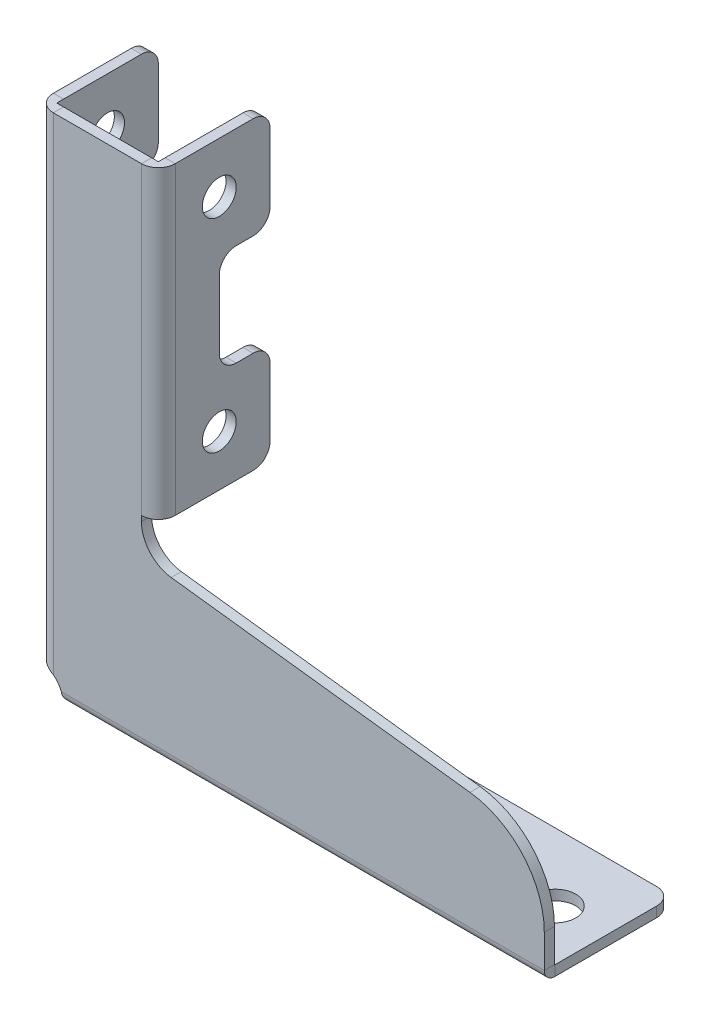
ISO-10303-21;
HEADER;
FILE_DESCRIPTION(('STEP AP214'),'2;1');
FILE_NAME('part.step','',(''),(''),'','','');
FILE_SCHEMA(('AUTOMOTIVE_DESIGN { 1 0 10303 214 1 1 1 1 }'));
ENDSEC;
DATA;
#1=APPLICATION_CONTEXT('core data for automotive mechanical design processes');
#2=APPLICATION_PROTOCOL_DEFINITION('international standard','automotive_design',2000,#1);
#3=PRODUCT_CONTEXT('',#1,'mechanical');
#4=PRODUCT('Part','Part','',(#3));
#5=PRODUCT_RELATED_PRODUCT_CATEGORY('part','',(#4));
#6=PRODUCT_DEFINITION_FORMATION('','',#4);
#7=PRODUCT_DEFINITION_CONTEXT('part definition',#1,'design');
#8=PRODUCT_DEFINITION('design','',#6,#7);
#9=PRODUCT_DEFINITION_SHAPE('','',#8);
#10=(LENGTH_UNIT() NAMED_UNIT(*) SI_UNIT(.MILLI.,.METRE.));
#11=(NAMED_UNIT(*) PLANE_ANGLE_UNIT() SI_UNIT($,.RADIAN.));
#12=(NAMED_UNIT(*) SI_UNIT($,.STERADIAN.) SOLID_ANGLE_UNIT());
#13=UNCERTAINTY_MEASURE_WITH_UNIT(LENGTH_MEASURE(1.E-05),#10,'distance_accuracy_value','');
#14=(GEOMETRIC_REPRESENTATION_CONTEXT(3) GLOBAL_UNCERTAINTY_ASSIGNED_CONTEXT((#13)) GLOBAL_UNIT_ASSIGNED_CONTEXT((#10,
#11,#12)) REPRESENTATION_CONTEXT('',''));
#15=CARTESIAN_POINT('',(0.,0.,0.));
#16=DIRECTION('',(0.,0.,1.));
#17=DIRECTION('',(1.,0.,0.));
#18=AXIS2_PLACEMENT_3D('',#15,#16,#17);
#19=CARTESIAN_POINT('',(22.178536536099,142.971937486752,-30.0022128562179));
#20=DIRECTION('',(0.,0.,1.));
#21=DIRECTION('',(0.,-1.,0.));
#22=AXIS2_PLACEMENT_3D('',#19,#20,#21);
#23=PLANE('',#22);
#24=DIRECTION('',(0.,1.,0.));
#25=VECTOR('',#24,1.);
#26=CARTESIAN_POINT('',(22.178536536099,142.971937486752,-30.0022128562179));
#27=LINE('',#26,#25);
#28=CARTESIAN_POINT('',(22.178536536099,117.971937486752,-30.0022128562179));
#29=VERTEX_POINT('',#28);
#30=CARTESIAN_POINT('',(22.178536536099,137.971937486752,-30.0022128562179));
#31=VERTEX_POINT('',#30);
#32=EDGE_CURVE('E1010',#29,#31,#27,.T.);
#33=ORIENTED_EDGE('',*,*,#32,.F.);
#34=DIRECTION('',(-1.,0.,0.));
#35=VECTOR('',#34,1.);
#36=CARTESIAN_POINT('',(22.178536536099,117.971937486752,-30.0022128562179));
#37=LINE('',#36,#35);
#38=CARTESIAN_POINT('',(19.178536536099,117.971937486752,-30.0022128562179));
#39=VERTEX_POINT('',#38);
#40=EDGE_CURVE('E608',#29,#39,#37,.T.);
#41=ORIENTED_EDGE('',*,*,#40,.T.);
#42=DIRECTION('',(0.,1.,0.));
#43=VECTOR('',#42,1.);
#44=CARTESIAN_POINT('',(19.178536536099,142.971937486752,-30.0022128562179));
#45=LINE('',#44,#43);
#46=CARTESIAN_POINT('',(19.178536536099,137.971937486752,-30.0022128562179));
#47=VERTEX_POINT('',#46);
#48=EDGE_CURVE('E970',#39,#47,#45,.T.);
#49=ORIENTED_EDGE('',*,*,#48,.T.);
#50=DIRECTION('',(-1.,0.,0.));
#51=VECTOR('',#50,1.);
#52=CARTESIAN_POINT('',(22.178536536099,137.971937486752,-30.0022128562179));
#53=LINE('',#52,#51);
#54=EDGE_CURVE('E606',#47,#31,#53,.F.);
#55=ORIENTED_EDGE('',*,*,#54,.T.);
#56=EDGE_LOOP('',(#33,#41,#49,#55));
#57=FACE_BOUND('',#56,.T.);
#58=ADVANCED_FACE('F61',(#57),#23,.F.);
#59=CARTESIAN_POINT('',(-13.8214634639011,142.971937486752,-30.0022128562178));
#60=DIRECTION('',(0.,0.,1.));
#61=DIRECTION('',(1.,0.,0.));
#62=AXIS2_PLACEMENT_3D('',#59,#60,#61);
#63=PLANE('',#62);
#64=DIRECTION('',(0.,-1.,0.));
#65=VECTOR('',#64,1.);
#66=CARTESIAN_POINT('',(-10.8214634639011,142.971937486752,-30.0022128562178));
#67=LINE('',#66,#65);
#68=CARTESIAN_POINT('',(-10.8214634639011,137.971937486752,-30.0022128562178));
#69=VERTEX_POINT('',#68);
#70=CARTESIAN_POINT('',(-10.8214634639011,117.971937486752,-30.0022128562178));
#71=VERTEX_POINT('',#70);
#72=EDGE_CURVE('E890',#69,#71,#67,.T.);
#73=ORIENTED_EDGE('',*,*,#72,.T.);
#74=DIRECTION('',(-1.,0.,0.));
#75=VECTOR('',#74,1.);
#76=CARTESIAN_POINT('',(-13.8214634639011,117.971937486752,-30.0022128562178));
#77=LINE('',#76,#75);
#78=CARTESIAN_POINT('',(-13.8214634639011,117.971937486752,-30.0022128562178));
#79=VERTEX_POINT('',#78);
#80=EDGE_CURVE('E598',#71,#79,#77,.T.);
#81=ORIENTED_EDGE('',*,*,#80,.T.);
#82=DIRECTION('',(0.,-1.,0.));
#83=VECTOR('',#82,1.);
#84=CARTESIAN_POINT('',(-13.8214634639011,142.971937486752,-30.0022128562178));
#85=LINE('',#84,#83);
#86=CARTESIAN_POINT('',(-13.8214634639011,137.971937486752,-30.0022128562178));
#87=VERTEX_POINT('',#86);
#88=EDGE_CURVE('E882',#87,#79,#85,.T.);
#89=ORIENTED_EDGE('',*,*,#88,.F.);
#90=DIRECTION('',(1.,0.,0.));
#91=VECTOR('',#90,1.);
#92=CARTESIAN_POINT('',(-13.8214634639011,137.971937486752,-30.0022128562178));
#93=LINE('',#92,#91);
#94=EDGE_CURVE('E595',#87,#69,#93,.T.);
#95=ORIENTED_EDGE('',*,*,#94,.T.);
#96=EDGE_LOOP('',(#73,#81,#89,#95));
#97=FACE_BOUND('',#96,.T.);
#98=ADVANCED_FACE('F1209',(#97),#63,.F.);
#99=CARTESIAN_POINT('',(27.1785365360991,51.4305528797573,3.));
#100=DIRECTION('',(0.,0.,-1.));
#101=DIRECTION('',(-1.,0.,0.));
#102=AXIS2_PLACEMENT_3D('',#99,#100,#101);
#103=PLANE('',#102);
#104=CARTESIAN_POINT('',(-13.4731138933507,-6.67971294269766,3.));
#105=DIRECTION('',(0.,0.,-1.));
#106=DIRECTION('',(1.,0.,0.));
#107=AXIS2_PLACEMENT_3D('',#104,#105,#106);
#108=CIRCLE('',#107,7.49999999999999);
#109=CARTESIAN_POINT('',(-8.8214634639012,-0.796503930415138,3.));
#110=VERTEX_POINT('',#109);
#111=CARTESIAN_POINT('',(-6.49612171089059,-3.928062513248,3.));
#112=VERTEX_POINT('',#111);
#113=EDGE_CURVE('E1038',#110,#112,#108,.T.);
#114=ORIENTED_EDGE('',*,*,#113,.T.);
#115=DIRECTION('',(1.,0.,0.));
#116=VECTOR('',#115,1.);
#117=CARTESIAN_POINT('',(27.1785365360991,-3.928062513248,3.));
#118=LINE('',#117,#116);
#119=CARTESIAN_POINT('',(136.178536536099,-3.928062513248,3.));
#120=VERTEX_POINT('',#119);
#121=EDGE_CURVE('E1049',#112,#120,#118,.T.);
#122=ORIENTED_EDGE('',*,*,#121,.T.);
#123=DIRECTION('',(0.,1.,0.));
#124=VECTOR('',#123,1.);
#125=CARTESIAN_POINT('',(136.178536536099,5.85380587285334,3.));
#126=LINE('',#125,#124);
#127=CARTESIAN_POINT('',(136.178536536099,5.85380587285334,3.));
#128=VERTEX_POINT('',#127);
#129=EDGE_CURVE('E982',#120,#128,#126,.T.);
#130=ORIENTED_EDGE('',*,*,#129,.T.);
#131=CARTESIAN_POINT('',(111.178536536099,5.85380587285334,3.));
#132=DIRECTION('',(0.,0.,1.));
#133=DIRECTION('',(1.,0.,0.));
#134=AXIS2_PLACEMENT_3D('',#131,#132,#133);
#135=CIRCLE('',#134,25.);
#136=CARTESIAN_POINT('',(114.225270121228,30.6674596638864,3.));
#137=VERTEX_POINT('',#136);
#138=EDGE_CURVE('E980',#128,#137,#135,.T.);
#139=ORIENTED_EDGE('',*,*,#138,.T.);
#140=DIRECTION('',(-0.992546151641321,0.121869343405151,0.));
#141=VECTOR('',#140,1.);
#142=CARTESIAN_POINT('',(114.225270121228,30.6674596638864,3.));
#143=LINE('',#142,#141);
#144=CARTESIAN_POINT('',(25.9598431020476,41.5050913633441,3.));
#145=VERTEX_POINT('',#144);
#146=EDGE_CURVE('E978',#137,#145,#143,.T.);
#147=ORIENTED_EDGE('',*,*,#146,.T.);
#148=CARTESIAN_POINT('',(27.1785365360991,51.4305528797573,3.));
#149=DIRECTION('',(0.,0.,-1.));
#150=DIRECTION('',(-1.,0.,0.));
#151=AXIS2_PLACEMENT_3D('',#148,#149,#150);
#152=CIRCLE('',#151,10.);
#153=CARTESIAN_POINT('',(17.1785365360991,51.4305528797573,3.));
#154=VERTEX_POINT('',#153);
#155=EDGE_CURVE('E976',#145,#154,#152,.T.);
#156=ORIENTED_EDGE('',*,*,#155,.T.);
#157=DIRECTION('',(0.,1.,0.));
#158=VECTOR('',#157,1.);
#159=CARTESIAN_POINT('',(17.1785365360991,52.9719374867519,3.));
#160=LINE('',#159,#158);
#161=CARTESIAN_POINT('',(17.1785365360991,52.9719374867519,3.));
#162=VERTEX_POINT('',#161);
#163=EDGE_CURVE('E974',#154,#162,#160,.T.);
#164=ORIENTED_EDGE('',*,*,#163,.T.);
#165=DIRECTION('',(0.,-1.,0.));
#166=VECTOR('',#165,1.);
#167=CARTESIAN_POINT('',(17.1785365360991,51.4305528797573,3.));
#168=LINE('',#167,#166);
#169=CARTESIAN_POINT('',(17.1785365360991,142.971937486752,3.));
#170=VERTEX_POINT('',#169);
#171=EDGE_CURVE('E966',#170,#162,#168,.T.);
#172=ORIENTED_EDGE('',*,*,#171,.F.);
#173=DIRECTION('',(-1.,0.,0.));
#174=VECTOR('',#173,1.);
#175=CARTESIAN_POINT('',(-42.3214634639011,142.971937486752,3.));
#176=LINE('',#175,#174);
#177=CARTESIAN_POINT('',(-8.82146346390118,142.971937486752,3.));
#178=VERTEX_POINT('',#177);
#179=EDGE_CURVE('E1036',#170,#178,#176,.T.);
#180=ORIENTED_EDGE('',*,*,#179,.T.);
#181=DIRECTION('',(0.,1.,0.));
#182=VECTOR('',#181,1.);
#183=CARTESIAN_POINT('',(-8.82146346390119,51.4305528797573,3.));
#184=LINE('',#183,#182);
#185=EDGE_CURVE('E1023',#110,#178,#184,.T.);
#186=ORIENTED_EDGE('',*,*,#185,.F.);
#187=EDGE_LOOP('',(#114,#122,#130,#139,#147,#156,#164,#172,#180,#186));
#188=FACE_BOUND('',#187,.T.);
#189=ADVANCED_FACE('F1074',(#188),#103,.F.);
#190=CARTESIAN_POINT('',(-13.4731138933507,-6.67971294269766,3.));
#191=DIRECTION('',(0.,0.,-1.));
#192=DIRECTION('',(-1.,0.,0.));
#193=AXIS2_PLACEMENT_3D('',#190,#191,#192);
#194=CYLINDRICAL_SURFACE('',#193,7.49999999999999);
#195=CARTESIAN_POINT('',(-13.4731138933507,-6.67971294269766,0.));
#196=DIRECTION('',(0.,0.,-1.));
#197=DIRECTION('',(1.,0.,0.));
#198=AXIS2_PLACEMENT_3D('',#195,#196,#197);
#199=CIRCLE('',#198,7.49999999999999);
#200=CARTESIAN_POINT('',(-8.8214634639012,-0.796503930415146,0.));
#201=VERTEX_POINT('',#200);
#202=CARTESIAN_POINT('',(-6.49612171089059,-3.928062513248,0.));
#203=VERTEX_POINT('',#202);
#204=EDGE_CURVE('E1039',#201,#203,#199,.T.);
#205=ORIENTED_EDGE('',*,*,#204,.T.);
#206=CARTESIAN_POINT('',(-6.49612171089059,-3.928062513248,3.));
#207=CARTESIAN_POINT('',(-6.49612171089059,-3.928062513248,0.));
#208=B_SPLINE_CURVE_WITH_KNOTS('',1,(#206,#207),.UNSPECIFIED.,.F.,.F.,(2,2),(0.,1.),.UNSPECIFIED.);
#209=EDGE_CURVE('E859',#203,#112,#208,.F.);
#210=ORIENTED_EDGE('',*,*,#209,.T.);
#211=ORIENTED_EDGE('',*,*,#113,.F.);
#212=CARTESIAN_POINT('',(-8.8214634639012,-0.796503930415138,0.));
#213=CARTESIAN_POINT('',(-8.8214634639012,-0.796503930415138,3.));
#214=B_SPLINE_CURVE_WITH_KNOTS('',1,(#212,#213),.UNSPECIFIED.,.F.,.F.,(2,2),(0.,1.),.UNSPECIFIED.);
#215=EDGE_CURVE('E1034',#201,#110,#214,.T.);
#216=ORIENTED_EDGE('',*,*,#215,.F.);
#217=EDGE_LOOP('',(#205,#210,#211,#216));
#218=FACE_BOUND('',#217,.T.);
#219=ADVANCED_FACE('F1063',(#218),#194,.F.);
#220=CARTESIAN_POINT('',(136.178536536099,5.85380587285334,3.));
#221=DIRECTION('',(-1.,0.,0.));
#222=DIRECTION('',(0.,-1.,0.));
#223=AXIS2_PLACEMENT_3D('',#220,#221,#222);
#224=PLANE('',#223);
#225=ORIENTED_EDGE('',*,*,#129,.F.);
#226=DIRECTION('',(0.,0.,-1.));
#227=VECTOR('',#226,1.);
#228=CARTESIAN_POINT('',(136.178536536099,-3.92806251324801,3.));
#229=LINE('',#228,#227);
#230=CARTESIAN_POINT('',(136.178536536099,-3.92806251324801,0.));
#231=VERTEX_POINT('',#230);
#232=EDGE_CURVE('E548',#120,#231,#229,.T.);
#233=ORIENTED_EDGE('',*,*,#232,.T.);
#234=DIRECTION('',(0.,1.,0.));
#235=VECTOR('',#234,1.);
#236=CARTESIAN_POINT('',(136.178536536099,5.85380587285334,0.));
#237=LINE('',#236,#235);
#238=CARTESIAN_POINT('',(136.178536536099,5.85380587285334,0.));
#239=VERTEX_POINT('',#238);
#240=EDGE_CURVE('E986',#231,#239,#237,.T.);
#241=ORIENTED_EDGE('',*,*,#240,.T.);
#242=DIRECTION('',(0.,0.,-1.));
#243=VECTOR('',#242,1.);
#244=CARTESIAN_POINT('',(136.178536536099,5.85380587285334,3.));
#245=LINE('',#244,#243);
#246=EDGE_CURVE('E983',#128,#239,#245,.T.);
#247=ORIENTED_EDGE('',*,*,#246,.F.);
#248=EDGE_LOOP('',(#225,#233,#241,#247));
#249=FACE_BOUND('',#248,.T.);
#250=ADVANCED_FACE('F1073',(#249),#224,.F.);
#251=CARTESIAN_POINT('',(27.1785365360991,51.4305528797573,0.));
#252=DIRECTION('',(0.,0.,-1.));
#253=DIRECTION('',(-1.,0.,0.));
#254=AXIS2_PLACEMENT_3D('',#251,#252,#253);
#255=PLANE('',#254);
#256=DIRECTION('',(1.,0.,0.));
#257=VECTOR('',#256,1.);
#258=CARTESIAN_POINT('',(27.1785365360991,-3.928062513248,0.));
#259=LINE('',#258,#257);
#260=EDGE_CURVE('E1061',#203,#231,#259,.T.);
#261=ORIENTED_EDGE('',*,*,#260,.F.);
#262=ORIENTED_EDGE('',*,*,#204,.F.);
#263=CARTESIAN_POINT('',(-10.8214634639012,0.575904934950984,0.));
#264=CARTESIAN_POINT('',(-10.7928154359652,0.569403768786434,0.));
#265=CARTESIAN_POINT('',(-10.764252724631,0.562539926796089,0.));
#266=CARTESIAN_POINT('',(-10.7072961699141,0.548136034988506,0.));
#267=CARTESIAN_POINT('',(-10.6789023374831,0.540595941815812,0.));
#268=CARTESIAN_POINT('',(-10.5938589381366,0.517003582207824,0.));
#269=CARTESIAN_POINT('',(-10.537466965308,0.500006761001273,0.));
#270=CARTESIAN_POINT('',(-10.4255973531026,0.463118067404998,0.));
#271=CARTESIAN_POINT('',(-10.3701202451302,0.443224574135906,0.));
#272=CARTESIAN_POINT('',(-10.2611947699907,0.400644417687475,0.));
#273=CARTESIAN_POINT('',(-10.207728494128,0.378003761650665,0.));
#274=CARTESIAN_POINT('',(-10.1022841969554,0.329572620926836,0.));
#275=CARTESIAN_POINT('',(-10.0503051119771,0.303784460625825,0.));
#276=CARTESIAN_POINT('',(-9.94807412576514,0.249043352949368,0.));
#277=CARTESIAN_POINT('',(-9.89782145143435,0.220091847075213,0.));
#278=CARTESIAN_POINT('',(-9.77404094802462,0.143536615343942,0.));
#279=CARTESIAN_POINT('',(-9.70172596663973,0.0939553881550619,0.));
#280=CARTESIAN_POINT('',(-9.56176171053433,-0.0114246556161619,0.));
#281=CARTESIAN_POINT('',(-9.49411488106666,-0.0672266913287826,0.));
#282=CARTESIAN_POINT('',(-9.3631239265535,-0.184058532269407,0.));
#283=CARTESIAN_POINT('',(-9.29979512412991,-0.24510537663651,0.));
#284=CARTESIAN_POINT('',(-9.17718780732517,-0.371088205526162,0.));
#285=CARTESIAN_POINT('',(-9.11790867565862,-0.436023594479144,0.));
#286=CARTESIAN_POINT('',(-9.01883879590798,-0.550229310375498,0.));
#287=CARTESIAN_POINT('',(-8.97823419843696,-0.598801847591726,0.));
#288=CARTESIAN_POINT('',(-8.89870732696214,-0.696934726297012,0.));
#289=CARTESIAN_POINT('',(-8.85977812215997,-0.746489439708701,0.));
#290=CARTESIAN_POINT('',(-8.8214634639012,-0.796503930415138,0.));
#291=B_SPLINE_CURVE_WITH_KNOTS('',3,(#263,#264,#265,#266,#267,#268,#269,#270,#271,#272,#273,
#274,#275,#276,#277,#278,#279,#280,#281,#282,#283,#284,#285,#286,#287,#288,#289,#290),
.UNSPECIFIED.,.F.,.F.,(4,2,2,2,2,2,2,2,2,2,2,2,2,4),(0.,0.0881217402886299,0.176249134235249,
0.352871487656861,0.529593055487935,0.703682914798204,0.877644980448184,1.05152810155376,
1.31416895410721,1.57694635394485,1.84061230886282,2.10423798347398,2.29413679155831,
2.48315461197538),.UNSPECIFIED.);
#292=CARTESIAN_POINT('',(-10.8214634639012,0.575904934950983,0.));
#293=VERTEX_POINT('',#292);
#294=EDGE_CURVE('E423',#293,#201,#291,.T.);
#295=ORIENTED_EDGE('',*,*,#294,.F.);
#296=DIRECTION('',(0.,1.,0.));
#297=VECTOR('',#296,1.);
#298=CARTESIAN_POINT('',(-10.8214634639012,-7.03658751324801,0.));
#299=LINE('',#298,#297);
#300=CARTESIAN_POINT('',(-10.8214634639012,142.971937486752,0.));
#301=VERTEX_POINT('',#300);
#302=EDGE_CURVE('E1181',#293,#301,#299,.T.);
#303=ORIENTED_EDGE('',*,*,#302,.T.);
#304=DIRECTION('',(1.,0.,0.));
#305=VECTOR('',#304,1.);
#306=CARTESIAN_POINT('',(-8.82146346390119,142.971937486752,0.));
#307=LINE('',#306,#305);
#308=CARTESIAN_POINT('',(-8.82146346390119,142.971937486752,0.));
#309=VERTEX_POINT('',#308);
#310=EDGE_CURVE('E450',#301,#309,#307,.T.);
#311=ORIENTED_EDGE('',*,*,#310,.T.);
#312=DIRECTION('',(-1.,0.,0.));
#313=VECTOR('',#312,1.);
#314=CARTESIAN_POINT('',(-42.3214634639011,142.971937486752,0.));
#315=LINE('',#314,#313);
#316=CARTESIAN_POINT('',(17.1785365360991,142.971937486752,0.));
#317=VERTEX_POINT('',#316);
#318=EDGE_CURVE('E406',#317,#309,#315,.T.);
#319=ORIENTED_EDGE('',*,*,#318,.F.);
#320=DIRECTION('',(1.,0.,0.));
#321=VECTOR('',#320,1.);
#322=CARTESIAN_POINT('',(17.1785365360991,142.971937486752,0.));
#323=LINE('',#322,#321);
#324=CARTESIAN_POINT('',(19.1785365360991,142.971937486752,0.));
#325=VERTEX_POINT('',#324);
#326=EDGE_CURVE('E402',#317,#325,#323,.T.);
#327=ORIENTED_EDGE('',*,*,#326,.T.);
#328=DIRECTION('',(0.,1.,0.));
#329=VECTOR('',#328,1.);
#330=CARTESIAN_POINT('',(19.1785365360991,-7.03658751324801,0.));
#331=LINE('',#330,#329);
#332=CARTESIAN_POINT('',(19.1785365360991,52.9719374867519,0.));
#333=VERTEX_POINT('',#332);
#334=EDGE_CURVE('E386',#333,#325,#331,.T.);
#335=ORIENTED_EDGE('',*,*,#334,.F.);
#336=DIRECTION('',(1.,0.,0.));
#337=VECTOR('',#336,1.);
#338=CARTESIAN_POINT('',(17.1785365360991,52.9719374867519,0.));
#339=LINE('',#338,#337);
#340=CARTESIAN_POINT('',(17.1785365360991,52.9719374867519,0.));
#341=VERTEX_POINT('',#340);
#342=EDGE_CURVE('E399',#341,#333,#339,.T.);
#343=ORIENTED_EDGE('',*,*,#342,.F.);
#344=DIRECTION('',(0.,1.,0.));
#345=VECTOR('',#344,1.);
#346=CARTESIAN_POINT('',(17.1785365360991,52.9719374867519,0.));
#347=LINE('',#346,#345);
#348=CARTESIAN_POINT('',(17.1785365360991,51.4305528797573,0.));
#349=VERTEX_POINT('',#348);
#350=EDGE_CURVE('E971',#349,#341,#347,.T.);
#351=ORIENTED_EDGE('',*,*,#350,.F.);
#352=CARTESIAN_POINT('',(27.1785365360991,51.4305528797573,0.));
#353=DIRECTION('',(0.,0.,-1.));
#354=DIRECTION('',(-1.,0.,0.));
#355=AXIS2_PLACEMENT_3D('',#352,#353,#354);
#356=CIRCLE('',#355,10.);
#357=CARTESIAN_POINT('',(25.9598431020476,41.5050913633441,0.));
#358=VERTEX_POINT('',#357);
#359=EDGE_CURVE('E997',#358,#349,#356,.T.);
#360=ORIENTED_EDGE('',*,*,#359,.F.);
#361=DIRECTION('',(-0.992546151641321,0.121869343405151,0.));
#362=VECTOR('',#361,1.);
#363=CARTESIAN_POINT('',(114.225270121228,30.6674596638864,0.));
#364=LINE('',#363,#362);
#365=CARTESIAN_POINT('',(114.225270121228,30.6674596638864,0.));
#366=VERTEX_POINT('',#365);
#367=EDGE_CURVE('E992',#366,#358,#364,.T.);
#368=ORIENTED_EDGE('',*,*,#367,.F.);
#369=CARTESIAN_POINT('',(111.178536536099,5.85380587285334,0.));
#370=DIRECTION('',(0.,0.,1.));
#371=DIRECTION('',(1.,0.,0.));
#372=AXIS2_PLACEMENT_3D('',#369,#370,#371);
#373=CIRCLE('',#372,25.);
#374=EDGE_CURVE('E987',#239,#366,#373,.T.);
#375=ORIENTED_EDGE('',*,*,#374,.F.);
#376=ORIENTED_EDGE('',*,*,#240,.F.);
#377=EDGE_LOOP('',(#261,#262,#295,#303,#311,#319,#327,#335,#343,#351,#360,#368,#375,#376));
#378=FACE_BOUND('',#377,.T.);
#379=ADVANCED_FACE('F404',(#378),#255,.T.);
#380=CARTESIAN_POINT('',(22.1785365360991,52.9719374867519,3.49778714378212));
#381=DIRECTION('',(0.,1.,0.));
#382=DIRECTION('',(1.,0.,0.));
#383=AXIS2_PLACEMENT_3D('',#380,#381,#382);
#384=PLANE('',#383);
#385=DIRECTION('',(0.,0.,-1.));
#386=VECTOR('',#385,1.);
#387=CARTESIAN_POINT('',(19.1785365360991,52.9719374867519,3.49778714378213));
#388=LINE('',#387,#386);
#389=CARTESIAN_POINT('',(19.1785365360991,52.9719374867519,-2.00000000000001));
#390=VERTEX_POINT('',#389);
#391=CARTESIAN_POINT('',(19.178536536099,52.9719374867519,-25.0022128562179));
#392=VERTEX_POINT('',#391);
#393=EDGE_CURVE('E1024',#390,#392,#388,.T.);
#394=ORIENTED_EDGE('',*,*,#393,.T.);
#395=DIRECTION('',(-1.,0.,0.));
#396=VECTOR('',#395,1.);
#397=CARTESIAN_POINT('',(22.178536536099,52.9719374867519,-25.0022128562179));
#398=LINE('',#397,#396);
#399=CARTESIAN_POINT('',(22.178536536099,52.9719374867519,-25.0022128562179));
#400=VERTEX_POINT('',#399);
#401=EDGE_CURVE('E663',#392,#400,#398,.F.);
#402=ORIENTED_EDGE('',*,*,#401,.T.);
#403=DIRECTION('',(0.,0.,-1.));
#404=VECTOR('',#403,1.);
#405=CARTESIAN_POINT('',(22.1785365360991,52.9719374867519,3.49778714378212));
#406=LINE('',#405,#404);
#407=CARTESIAN_POINT('',(22.1785365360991,52.9719374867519,-2.00000000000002));
#408=VERTEX_POINT('',#407);
#409=EDGE_CURVE('E1018',#408,#400,#406,.T.);
#410=ORIENTED_EDGE('',*,*,#409,.F.);
#411=DIRECTION('',(-1.,0.,0.));
#412=VECTOR('',#411,1.);
#413=CARTESIAN_POINT('',(22.1785365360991,52.9719374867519,-2.00000000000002));
#414=LINE('',#413,#412);
#415=EDGE_CURVE('E1020',#408,#390,#414,.T.);
#416=ORIENTED_EDGE('',*,*,#415,.T.);
#417=EDGE_LOOP('',(#394,#402,#410,#416));
#418=FACE_BOUND('',#417,.T.);
#419=ADVANCED_FACE('F1149',(#418),#384,.F.);
#420=CARTESIAN_POINT('',(22.1785365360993,142.971937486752,62.9977871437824));
#421=DIRECTION('',(0.,-1.,0.));
#422=DIRECTION('',(0.,0.,-1.));
#423=AXIS2_PLACEMENT_3D('',#420,#421,#422);
#424=PLANE('',#423);
#425=DIRECTION('',(0.,0.,1.));
#426=VECTOR('',#425,1.);
#427=CARTESIAN_POINT('',(22.1785365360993,142.971937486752,62.9977871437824));
#428=LINE('',#427,#426);
#429=CARTESIAN_POINT('',(22.178536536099,142.971937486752,-25.0022128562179));
#430=VERTEX_POINT('',#429);
#431=CARTESIAN_POINT('',(22.1785365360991,142.971937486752,-2.00000000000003));
#432=VERTEX_POINT('',#431);
#433=EDGE_CURVE('E1009',#430,#432,#428,.T.);
#434=ORIENTED_EDGE('',*,*,#433,.F.);
#435=DIRECTION('',(-1.,0.,0.));
#436=VECTOR('',#435,1.);
#437=CARTESIAN_POINT('',(22.178536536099,142.971937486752,-25.0022128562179));
#438=LINE('',#437,#436);
#439=CARTESIAN_POINT('',(19.178536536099,142.971937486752,-25.0022128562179));
#440=VERTEX_POINT('',#439);
#441=EDGE_CURVE('E665',#430,#440,#438,.T.);
#442=ORIENTED_EDGE('',*,*,#441,.T.);
#443=DIRECTION('',(0.,0.,1.));
#444=VECTOR('',#443,1.);
#445=CARTESIAN_POINT('',(19.1785365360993,142.971937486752,62.9977871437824));
#446=LINE('',#445,#444);
#447=CARTESIAN_POINT('',(19.1785365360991,142.971937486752,-2.00000000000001));
#448=VERTEX_POINT('',#447);
#449=EDGE_CURVE('E1014',#440,#448,#446,.T.);
#450=ORIENTED_EDGE('',*,*,#449,.T.);
#451=DIRECTION('',(1.,0.,0.));
#452=VECTOR('',#451,1.);
#453=CARTESIAN_POINT('',(22.1785365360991,142.971937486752,-2.00000000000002));
#454=LINE('',#453,#452);
#455=EDGE_CURVE('E416',#448,#432,#454,.T.);
#456=ORIENTED_EDGE('',*,*,#455,.T.);
#457=EDGE_LOOP('',(#434,#442,#450,#456));
#458=FACE_BOUND('',#457,.T.);
#459=ADVANCED_FACE('F1315',(#458),#424,.F.);
#460=CARTESIAN_POINT('',(22.1785365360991,51.4305528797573,-6.50221285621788));
#461=DIRECTION('',(-1.,0.,0.));
#462=DIRECTION('',(0.,0.,1.));
#463=AXIS2_PLACEMENT_3D('',#460,#461,#462);
#464=PLANE('',#463);
#465=CARTESIAN_POINT('',(22.1785365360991,127.971937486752,-15.0022128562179));
#466=DIRECTION('',(1.,0.,0.));
#467=DIRECTION('',(0.,0.,-1.));
#468=AXIS2_PLACEMENT_3D('',#465,#466,#467);
#469=CIRCLE('',#468,5.);
#470=CARTESIAN_POINT('',(22.1785365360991,127.971937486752,-20.0022128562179));
#471=VERTEX_POINT('',#470);
#472=EDGE_CURVE('E721',#471,#471,#469,.T.);
#473=ORIENTED_EDGE('',*,*,#472,.F.);
#474=EDGE_LOOP('',(#473));
#475=FACE_BOUND('',#474,.T.);
#476=CARTESIAN_POINT('',(22.1785365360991,67.9719374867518,-15.0022128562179));
#477=DIRECTION('',(1.,0.,0.));
#478=DIRECTION('',(0.,0.,-1.));
#479=AXIS2_PLACEMENT_3D('',#476,#477,#478);
#480=CIRCLE('',#479,4.99999999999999);
#481=CARTESIAN_POINT('',(22.1785365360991,67.9719374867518,-20.0022128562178));
#482=VERTEX_POINT('',#481);
#483=EDGE_CURVE('E728',#482,#482,#480,.T.);
#484=ORIENTED_EDGE('',*,*,#483,.F.);
#485=EDGE_LOOP('',(#484));
#486=FACE_BOUND('',#485,.T.);
#487=DIRECTION('',(0.,0.,-1.));
#488=VECTOR('',#487,1.);
#489=CARTESIAN_POINT('',(22.1785365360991,112.971937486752,-6.50221285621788));
#490=LINE('',#489,#488);
#491=CARTESIAN_POINT('',(22.178536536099,112.971937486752,-20.0022128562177));
#492=VERTEX_POINT('',#491);
#493=CARTESIAN_POINT('',(22.178536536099,112.971937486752,-25.0022128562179));
#494=VERTEX_POINT('',#493);
#495=EDGE_CURVE('E715',#492,#494,#490,.T.);
#496=ORIENTED_EDGE('',*,*,#495,.T.);
#497=CARTESIAN_POINT('',(22.178536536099,117.971937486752,-25.0022128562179));
#498=DIRECTION('',(-1.,0.,0.));
#499=DIRECTION('',(0.,0.,1.));
#500=AXIS2_PLACEMENT_3D('',#497,#498,#499);
#501=CIRCLE('',#500,5.);
#502=EDGE_CURVE('E630',#494,#29,#501,.F.);
#503=ORIENTED_EDGE('',*,*,#502,.T.);
#504=ORIENTED_EDGE('',*,*,#32,.T.);
#505=CARTESIAN_POINT('',(22.178536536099,137.971937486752,-25.0022128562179));
#506=DIRECTION('',(-1.,0.,0.));
#507=DIRECTION('',(0.,0.,1.));
#508=AXIS2_PLACEMENT_3D('',#505,#506,#507);
#509=CIRCLE('',#508,5.);
#510=EDGE_CURVE('E624',#31,#430,#509,.F.);
#511=ORIENTED_EDGE('',*,*,#510,.T.);
#512=ORIENTED_EDGE('',*,*,#433,.T.);
#513=DIRECTION('',(0.,-1.,0.));
#514=VECTOR('',#513,1.);
#515=CARTESIAN_POINT('',(22.1785365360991,51.4305528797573,-2.00000000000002));
#516=LINE('',#515,#514);
#517=EDGE_CURVE('E1015',#432,#408,#516,.T.);
#518=ORIENTED_EDGE('',*,*,#517,.T.);
#519=ORIENTED_EDGE('',*,*,#409,.T.);
#520=CARTESIAN_POINT('',(22.178536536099,57.9719374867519,-25.0022128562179));
#521=DIRECTION('',(-1.,0.,0.));
#522=DIRECTION('',(0.,0.,1.));
#523=AXIS2_PLACEMENT_3D('',#520,#521,#522);
#524=CIRCLE('',#523,5.);
#525=CARTESIAN_POINT('',(22.178536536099,57.9719374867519,-30.0022128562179));
#526=VERTEX_POINT('',#525);
#527=EDGE_CURVE('E626',#400,#526,#524,.F.);
#528=ORIENTED_EDGE('',*,*,#527,.T.);
#529=CARTESIAN_POINT('',(22.178536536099,77.9719374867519,-30.0022128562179));
#530=VERTEX_POINT('',#529);
#531=EDGE_CURVE('E1006',#526,#530,#27,.T.);
#532=ORIENTED_EDGE('',*,*,#531,.T.);
#533=CARTESIAN_POINT('',(22.178536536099,77.9719374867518,-25.0022128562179));
#534=DIRECTION('',(-1.,0.,0.));
#535=DIRECTION('',(0.,0.,1.));
#536=AXIS2_PLACEMENT_3D('',#533,#534,#535);
#537=CIRCLE('',#536,5.);
#538=CARTESIAN_POINT('',(22.178536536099,82.9719374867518,-25.0022128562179));
#539=VERTEX_POINT('',#538);
#540=EDGE_CURVE('E628',#530,#539,#537,.F.);
#541=ORIENTED_EDGE('',*,*,#540,.T.);
#542=DIRECTION('',(0.,0.,1.));
#543=VECTOR('',#542,1.);
#544=CARTESIAN_POINT('',(22.1785365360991,82.9719374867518,-6.50221285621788));
#545=LINE('',#544,#543);
#546=CARTESIAN_POINT('',(22.178536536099,82.9719374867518,-20.0022128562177));
#547=VERTEX_POINT('',#546);
#548=EDGE_CURVE('E698',#539,#547,#545,.T.);
#549=ORIENTED_EDGE('',*,*,#548,.T.);
#550=CARTESIAN_POINT('',(22.1785365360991,87.9719374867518,-20.0022128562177));
#551=DIRECTION('',(-1.,0.,0.));
#552=DIRECTION('',(0.,0.,1.));
#553=AXIS2_PLACEMENT_3D('',#550,#551,#552);
#554=CIRCLE('',#553,5.);
#555=CARTESIAN_POINT('',(22.1785365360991,87.9719374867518,-15.0022128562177));
#556=VERTEX_POINT('',#555);
#557=EDGE_CURVE('E12',#547,#556,#554,.T.);
#558=ORIENTED_EDGE('',*,*,#557,.T.);
#559=DIRECTION('',(0.,1.,0.));
#560=VECTOR('',#559,1.);
#561=CARTESIAN_POINT('',(22.1785365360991,51.4305528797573,-15.0022128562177));
#562=LINE('',#561,#560);
#563=CARTESIAN_POINT('',(22.1785365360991,107.971937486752,-15.0022128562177));
#564=VERTEX_POINT('',#563);
#565=EDGE_CURVE('E708',#556,#564,#562,.T.);
#566=ORIENTED_EDGE('',*,*,#565,.T.);
#567=CARTESIAN_POINT('',(22.1785365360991,107.971937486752,-20.0022128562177));
#568=DIRECTION('',(-1.,0.,0.));
#569=DIRECTION('',(0.,0.,1.));
#570=AXIS2_PLACEMENT_3D('',#567,#568,#569);
#571=CIRCLE('',#570,5.);
#572=EDGE_CURVE('E684',#564,#492,#571,.T.);
#573=ORIENTED_EDGE('',*,*,#572,.T.);
#574=EDGE_LOOP('',(#496,#503,#504,#511,#512,#518,#519,#528,#532,#541,#549,#558,#566,#573));
#575=FACE_BOUND('',#574,.T.);
#576=ADVANCED_FACE('F707',(#475,#486,#575),#464,.F.);
#577=CARTESIAN_POINT('',(19.178536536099,57.9719374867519,-30.0022128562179));
#578=VERTEX_POINT('',#577);
#579=CARTESIAN_POINT('',(19.178536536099,77.9719374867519,-30.0022128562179));
#580=VERTEX_POINT('',#579);
#581=EDGE_CURVE('E1011',#578,#580,#45,.T.);
#582=ORIENTED_EDGE('',*,*,#581,.T.);
#583=DIRECTION('',(-1.,0.,0.));
#584=VECTOR('',#583,1.);
#585=CARTESIAN_POINT('',(22.178536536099,77.9719374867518,-30.0022128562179));
#586=LINE('',#585,#584);
#587=EDGE_CURVE('E645',#580,#530,#586,.F.);
#588=ORIENTED_EDGE('',*,*,#587,.T.);
#589=ORIENTED_EDGE('',*,*,#531,.F.);
#590=DIRECTION('',(-1.,0.,0.));
#591=VECTOR('',#590,1.);
#592=CARTESIAN_POINT('',(22.178536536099,57.9719374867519,-30.0022128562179));
#593=LINE('',#592,#591);
#594=EDGE_CURVE('E642',#526,#578,#593,.T.);
#595=ORIENTED_EDGE('',*,*,#594,.T.);
#596=EDGE_LOOP('',(#582,#588,#589,#595));
#597=FACE_BOUND('',#596,.T.);
#598=ADVANCED_FACE('F1157',(#597),#23,.F.);
#599=CARTESIAN_POINT('',(19.1785365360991,51.4305528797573,-6.50221285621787));
#600=DIRECTION('',(-1.,0.,0.));
#601=DIRECTION('',(0.,0.,1.));
#602=AXIS2_PLACEMENT_3D('',#599,#600,#601);
#603=PLANE('',#602);
#604=ORIENTED_EDGE('',*,*,#48,.F.);
#605=CARTESIAN_POINT('',(19.178536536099,117.971937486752,-25.0022128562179));
#606=DIRECTION('',(-1.,0.,0.));
#607=DIRECTION('',(0.,0.,1.));
#608=AXIS2_PLACEMENT_3D('',#605,#606,#607);
#609=CIRCLE('',#608,5.);
#610=CARTESIAN_POINT('',(19.178536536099,112.971937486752,-25.0022128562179));
#611=VERTEX_POINT('',#610);
#612=EDGE_CURVE('E617',#39,#611,#609,.T.);
#613=ORIENTED_EDGE('',*,*,#612,.T.);
#614=DIRECTION('',(0.,0.,-1.));
#615=VECTOR('',#614,1.);
#616=CARTESIAN_POINT('',(19.1785365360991,112.971937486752,-6.50221285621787));
#617=LINE('',#616,#615);
#618=CARTESIAN_POINT('',(19.178536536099,112.971937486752,-20.0022128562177));
#619=VERTEX_POINT('',#618);
#620=EDGE_CURVE('E712',#619,#611,#617,.T.);
#621=ORIENTED_EDGE('',*,*,#620,.F.);
#622=CARTESIAN_POINT('',(19.1785365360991,107.971937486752,-20.0022128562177));
#623=DIRECTION('',(-1.,0.,0.));
#624=DIRECTION('',(0.,0.,1.));
#625=AXIS2_PLACEMENT_3D('',#622,#623,#624);
#626=CIRCLE('',#625,5.);
#627=CARTESIAN_POINT('',(19.1785365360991,107.971937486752,-15.0022128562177));
#628=VERTEX_POINT('',#627);
#629=EDGE_CURVE('E682',#619,#628,#626,.F.);
#630=ORIENTED_EDGE('',*,*,#629,.T.);
#631=DIRECTION('',(0.,1.,0.));
#632=VECTOR('',#631,1.);
#633=CARTESIAN_POINT('',(19.1785365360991,51.4305528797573,-15.0022128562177));
#634=LINE('',#633,#632);
#635=CARTESIAN_POINT('',(19.1785365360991,87.9719374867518,-15.0022128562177));
#636=VERTEX_POINT('',#635);
#637=EDGE_CURVE('E690',#636,#628,#634,.T.);
#638=ORIENTED_EDGE('',*,*,#637,.F.);
#639=CARTESIAN_POINT('',(19.1785365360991,87.9719374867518,-20.0022128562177));
#640=DIRECTION('',(-1.,0.,0.));
#641=DIRECTION('',(0.,0.,1.));
#642=AXIS2_PLACEMENT_3D('',#639,#640,#641);
#643=CIRCLE('',#642,5.);
#644=CARTESIAN_POINT('',(19.178536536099,82.9719374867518,-20.0022128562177));
#645=VERTEX_POINT('',#644);
#646=EDGE_CURVE('E69',#636,#645,#643,.F.);
#647=ORIENTED_EDGE('',*,*,#646,.T.);
#648=DIRECTION('',(0.,0.,1.));
#649=VECTOR('',#648,1.);
#650=CARTESIAN_POINT('',(19.1785365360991,82.9719374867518,-6.50221285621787));
#651=LINE('',#650,#649);
#652=CARTESIAN_POINT('',(19.178536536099,82.9719374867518,-25.0022128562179));
#653=VERTEX_POINT('',#652);
#654=EDGE_CURVE('E688',#653,#645,#651,.T.);
#655=ORIENTED_EDGE('',*,*,#654,.F.);
#656=CARTESIAN_POINT('',(19.178536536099,77.9719374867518,-25.0022128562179));
#657=DIRECTION('',(-1.,0.,0.));
#658=DIRECTION('',(0.,0.,1.));
#659=AXIS2_PLACEMENT_3D('',#656,#657,#658);
#660=CIRCLE('',#659,5.);
#661=EDGE_CURVE('E615',#653,#580,#660,.T.);
#662=ORIENTED_EDGE('',*,*,#661,.T.);
#663=ORIENTED_EDGE('',*,*,#581,.F.);
#664=CARTESIAN_POINT('',(19.178536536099,57.9719374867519,-25.0022128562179));
#665=DIRECTION('',(-1.,0.,0.));
#666=DIRECTION('',(0.,0.,1.));
#667=AXIS2_PLACEMENT_3D('',#664,#665,#666);
#668=CIRCLE('',#667,5.);
#669=EDGE_CURVE('E613',#578,#392,#668,.T.);
#670=ORIENTED_EDGE('',*,*,#669,.T.);
#671=ORIENTED_EDGE('',*,*,#393,.F.);
#672=DIRECTION('',(0.,0.,-1.));
#673=VECTOR('',#672,1.);
#674=CARTESIAN_POINT('',(19.1785365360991,52.9719374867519,-1.99999999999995));
#675=LINE('',#674,#673);
#676=EDGE_CURVE('E396',#333,#390,#675,.T.);
#677=ORIENTED_EDGE('',*,*,#676,.F.);
#678=ORIENTED_EDGE('',*,*,#334,.T.);
#679=DIRECTION('',(0.,0.,-1.));
#680=VECTOR('',#679,1.);
#681=CARTESIAN_POINT('',(19.1785365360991,142.971937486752,-2.00000000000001));
#682=LINE('',#681,#680);
#683=EDGE_CURVE('E393',#325,#448,#682,.T.);
#684=ORIENTED_EDGE('',*,*,#683,.T.);
#685=ORIENTED_EDGE('',*,*,#449,.F.);
#686=CARTESIAN_POINT('',(19.178536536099,137.971937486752,-25.0022128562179));
#687=DIRECTION('',(-1.,0.,0.));
#688=DIRECTION('',(0.,0.,1.));
#689=AXIS2_PLACEMENT_3D('',#686,#687,#688);
#690=CIRCLE('',#689,5.);
#691=EDGE_CURVE('E611',#440,#47,#690,.T.);
#692=ORIENTED_EDGE('',*,*,#691,.T.);
#693=EDGE_LOOP('',(#604,#613,#621,#630,#638,#647,#655,#662,#663,#670,#671,#677,#678,#684,#685,#692));
#694=FACE_BOUND('',#693,.T.);
#695=CARTESIAN_POINT('',(19.1785365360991,127.971937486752,-15.0022128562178));
#696=DIRECTION('',(-1.,0.,0.));
#697=DIRECTION('',(0.,0.,1.));
#698=AXIS2_PLACEMENT_3D('',#695,#696,#697);
#699=CIRCLE('',#698,5.);
#700=CARTESIAN_POINT('',(19.1785365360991,127.971937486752,-10.0022128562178));
#701=VERTEX_POINT('',#700);
#702=EDGE_CURVE('E542',#701,#701,#699,.T.);
#703=ORIENTED_EDGE('',*,*,#702,.F.);
#704=EDGE_LOOP('',(#703));
#705=FACE_BOUND('',#704,.T.);
#706=CARTESIAN_POINT('',(19.1785365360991,67.9719374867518,-15.0022128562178));
#707=DIRECTION('',(-1.,0.,0.));
#708=DIRECTION('',(0.,0.,1.));
#709=AXIS2_PLACEMENT_3D('',#706,#707,#708);
#710=CIRCLE('',#709,4.99999999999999);
#711=CARTESIAN_POINT('',(19.1785365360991,67.9719374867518,-10.0022128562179));
#712=VERTEX_POINT('',#711);
#713=EDGE_CURVE('E537',#712,#712,#710,.T.);
#714=ORIENTED_EDGE('',*,*,#713,.F.);
#715=EDGE_LOOP('',(#714));
#716=FACE_BOUND('',#715,.T.);
#717=ADVANCED_FACE('F389',(#694,#705,#716),#603,.T.);
#718=CARTESIAN_POINT('',(27.1785365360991,51.4305528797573,3.));
#719=DIRECTION('',(0.,0.,-1.));
#720=DIRECTION('',(-1.,0.,0.));
#721=AXIS2_PLACEMENT_3D('',#718,#719,#720);
#722=CYLINDRICAL_SURFACE('',#721,10.);
#723=ORIENTED_EDGE('',*,*,#359,.T.);
#724=DIRECTION('',(0.,0.,-1.));
#725=VECTOR('',#724,1.);
#726=CARTESIAN_POINT('',(17.1785365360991,51.4305528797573,3.));
#727=LINE('',#726,#725);
#728=EDGE_CURVE('E967',#154,#349,#727,.T.);
#729=ORIENTED_EDGE('',*,*,#728,.F.);
#730=ORIENTED_EDGE('',*,*,#155,.F.);
#731=DIRECTION('',(0.,0.,-1.));
#732=VECTOR('',#731,1.);
#733=CARTESIAN_POINT('',(25.9598431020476,41.5050913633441,3.));
#734=LINE('',#733,#732);
#735=EDGE_CURVE('E994',#145,#358,#734,.T.);
#736=ORIENTED_EDGE('',*,*,#735,.T.);
#737=EDGE_LOOP('',(#723,#729,#730,#736));
#738=FACE_BOUND('',#737,.T.);
#739=ADVANCED_FACE('F1135',(#738),#722,.F.);
#740=CARTESIAN_POINT('',(114.225270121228,30.6674596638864,3.));
#741=DIRECTION('',(-0.121869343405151,-0.992546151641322,0.));
#742=DIRECTION('',(0.992546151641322,-0.121869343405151,0.));
#743=AXIS2_PLACEMENT_3D('',#740,#741,#742);
#744=PLANE('',#743);
#745=ORIENTED_EDGE('',*,*,#367,.T.);
#746=ORIENTED_EDGE('',*,*,#735,.F.);
#747=ORIENTED_EDGE('',*,*,#146,.F.);
#748=DIRECTION('',(0.,0.,-1.));
#749=VECTOR('',#748,1.);
#750=CARTESIAN_POINT('',(114.225270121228,30.6674596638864,3.));
#751=LINE('',#750,#749);
#752=EDGE_CURVE('E989',#137,#366,#751,.T.);
#753=ORIENTED_EDGE('',*,*,#752,.T.);
#754=EDGE_LOOP('',(#745,#746,#747,#753));
#755=FACE_BOUND('',#754,.T.);
#756=ADVANCED_FACE('F1128',(#755),#744,.F.);
#757=CARTESIAN_POINT('',(111.178536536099,5.85380587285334,3.));
#758=DIRECTION('',(0.,0.,-1.));
#759=DIRECTION('',(-1.,0.,0.));
#760=AXIS2_PLACEMENT_3D('',#757,#758,#759);
#761=CYLINDRICAL_SURFACE('',#760,25.);
#762=ORIENTED_EDGE('',*,*,#374,.T.);
#763=ORIENTED_EDGE('',*,*,#752,.F.);
#764=ORIENTED_EDGE('',*,*,#138,.F.);
#765=ORIENTED_EDGE('',*,*,#246,.T.);
#766=EDGE_LOOP('',(#762,#763,#764,#765));
#767=FACE_BOUND('',#766,.T.);
#768=ADVANCED_FACE('F1123',(#767),#761,.T.);
#769=CARTESIAN_POINT('',(-42.3214634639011,142.971937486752,3.));
#770=DIRECTION('',(0.,-1.,0.));
#771=DIRECTION('',(1.,0.,0.));
#772=AXIS2_PLACEMENT_3D('',#769,#770,#771);
#773=PLANE('',#772);
#774=DIRECTION('',(0.,0.,-1.));
#775=VECTOR('',#774,1.);
#776=CARTESIAN_POINT('',(-8.82146346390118,142.971937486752,3.));
#777=LINE('',#776,#775);
#778=EDGE_CURVE('E1031',#178,#309,#777,.T.);
#779=ORIENTED_EDGE('',*,*,#778,.F.);
#780=ORIENTED_EDGE('',*,*,#179,.F.);
#781=DIRECTION('',(0.,0.,1.));
#782=VECTOR('',#781,1.);
#783=CARTESIAN_POINT('',(17.1785365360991,142.971937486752,3.));
#784=LINE('',#783,#782);
#785=EDGE_CURVE('E999',#317,#170,#784,.T.);
#786=ORIENTED_EDGE('',*,*,#785,.F.);
#787=ORIENTED_EDGE('',*,*,#318,.T.);
#788=EDGE_LOOP('',(#779,#780,#786,#787));
#789=FACE_BOUND('',#788,.T.);
#790=ADVANCED_FACE('F1326',(#789),#773,.F.);
#791=CARTESIAN_POINT('',(17.1785365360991,52.9719374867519,3.));
#792=DIRECTION('',(-1.,0.,0.));
#793=DIRECTION('',(0.,-1.,0.));
#794=AXIS2_PLACEMENT_3D('',#791,#792,#793);
#795=PLANE('',#794);
#796=ORIENTED_EDGE('',*,*,#350,.T.);
#797=DIRECTION('',(0.,0.,-1.));
#798=VECTOR('',#797,1.);
#799=CARTESIAN_POINT('',(17.1785365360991,52.9719374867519,3.));
#800=LINE('',#799,#798);
#801=EDGE_CURVE('E1001',#162,#341,#800,.T.);
#802=ORIENTED_EDGE('',*,*,#801,.F.);
#803=ORIENTED_EDGE('',*,*,#163,.F.);
#804=ORIENTED_EDGE('',*,*,#728,.T.);
#805=EDGE_LOOP('',(#796,#802,#803,#804));
#806=FACE_BOUND('',#805,.T.);
#807=ADVANCED_FACE('F1139',(#806),#795,.F.);
#808=CARTESIAN_POINT('',(17.1785365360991,142.971937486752,-2.));
#809=DIRECTION('',(0.,1.,0.));
#810=DIRECTION('',(0.,0.,1.));
#811=AXIS2_PLACEMENT_3D('',#808,#809,#810);
#812=PLANE('',#811);
#813=ORIENTED_EDGE('',*,*,#683,.F.);
#814=ORIENTED_EDGE('',*,*,#326,.F.);
#815=ORIENTED_EDGE('',*,*,#785,.T.);
#816=CARTESIAN_POINT('',(17.1785365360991,142.971937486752,-2.));
#817=DIRECTION('',(0.,-1.,0.));
#818=DIRECTION('',(0.,0.,-1.));
#819=AXIS2_PLACEMENT_3D('',#816,#817,#818);
#820=CIRCLE('',#819,5.);
#821=EDGE_CURVE('E899',#432,#170,#820,.T.);
#822=ORIENTED_EDGE('',*,*,#821,.F.);
#823=ORIENTED_EDGE('',*,*,#455,.F.);
#824=EDGE_LOOP('',(#813,#814,#815,#822,#823));
#825=FACE_BOUND('',#824,.T.);
#826=ADVANCED_FACE('F413',(#825),#812,.T.);
#827=CARTESIAN_POINT('',(17.1785365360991,52.9719374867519,-2.));
#828=DIRECTION('',(0.,-1.,0.));
#829=DIRECTION('',(0.,0.,-1.));
#830=AXIS2_PLACEMENT_3D('',#827,#828,#829);
#831=PLANE('',#830);
#832=ORIENTED_EDGE('',*,*,#676,.T.);
#833=ORIENTED_EDGE('',*,*,#415,.F.);
#834=CARTESIAN_POINT('',(17.1785365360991,52.9719374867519,-2.));
#835=DIRECTION('',(0.,1.,0.));
#836=DIRECTION('',(0.,0.,1.));
#837=AXIS2_PLACEMENT_3D('',#834,#835,#836);
#838=CIRCLE('',#837,5.);
#839=EDGE_CURVE('E964',#162,#408,#838,.T.);
#840=ORIENTED_EDGE('',*,*,#839,.F.);
#841=ORIENTED_EDGE('',*,*,#801,.T.);
#842=ORIENTED_EDGE('',*,*,#342,.T.);
#843=EDGE_LOOP('',(#832,#833,#840,#841,#842));
#844=FACE_BOUND('',#843,.T.);
#845=ADVANCED_FACE('F928',(#844),#831,.T.);
#846=CARTESIAN_POINT('',(17.1785365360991,7.75428032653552,-2.));
#847=DIRECTION('',(0.,1.,0.));
#848=DIRECTION('',(0.,0.,1.));
#849=AXIS2_PLACEMENT_3D('',#846,#847,#848);
#850=CYLINDRICAL_SURFACE('',#849,5.);
#851=ORIENTED_EDGE('',*,*,#171,.T.);
#852=ORIENTED_EDGE('',*,*,#839,.T.);
#853=ORIENTED_EDGE('',*,*,#517,.F.);
#854=ORIENTED_EDGE('',*,*,#821,.T.);
#855=EDGE_LOOP('',(#851,#852,#853,#854));
#856=FACE_BOUND('',#855,.T.);
#857=ADVANCED_FACE('F926',(#856),#850,.T.);
#858=CARTESIAN_POINT('',(-13.8214634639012,0.772404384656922,-2.00000000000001));
#859=CARTESIAN_POINT('',(-13.8214634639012,0.79981978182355,-1.16318865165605));
#860=CARTESIAN_POINT('',(-13.6132414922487,0.795231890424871,-0.421327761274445));
#861=CARTESIAN_POINT('',(-13.1720238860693,0.740799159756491,0.487158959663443));
#862=CARTESIAN_POINT('',(-13.003335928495,0.714704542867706,0.756788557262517));
#863=CARTESIAN_POINT('',(-12.7369519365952,0.663637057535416,1.1130266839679));
#864=CARTESIAN_POINT('',(-12.6458920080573,0.644626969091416,1.22379568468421));
#865=CARTESIAN_POINT('',(-12.5079075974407,0.61313044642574,1.37859552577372));
#866=CARTESIAN_POINT('',(-12.4616776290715,0.602134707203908,1.42830550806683));
#867=CARTESIAN_POINT('',(-12.3922056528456,0.584895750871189,1.50012995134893));
#868=CARTESIAN_POINT('',(-12.3690269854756,0.579025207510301,1.52361478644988));
#869=CARTESIAN_POINT('',(-12.3342536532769,0.57003305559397,1.55816976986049));
#870=CARTESIAN_POINT('',(-12.3226616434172,0.567004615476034,1.56957605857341));
#871=CARTESIAN_POINT('',(-12.3052755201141,0.562415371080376,1.58651907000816));
#872=CARTESIAN_POINT('',(-12.2994804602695,0.560877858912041,1.59213900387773));
#873=CARTESIAN_POINT('',(-12.2878915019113,0.557787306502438,1.60332367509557));
#874=CARTESIAN_POINT('',(-12.283671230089,0.556658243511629,1.60738426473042));
#875=CARTESIAN_POINT('',(-11.8048369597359,0.427647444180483,2.06507698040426));
#876=CARTESIAN_POINT('',(-11.2507898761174,0.251536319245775,2.41616060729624));
#877=CARTESIAN_POINT('',(-10.068442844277,-0.198856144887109,2.88355851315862));
#878=CARTESIAN_POINT('',(-9.44054500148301,-0.473187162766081,3.));
#879=CARTESIAN_POINT('',(-8.8214634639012,-0.796503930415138,3.));
#880=CARTESIAN_POINT('',(-10.8214634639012,0.772404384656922,-2.00000000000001));
#881=CARTESIAN_POINT('',(-10.8214634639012,0.799819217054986,-1.66528235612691));
#882=CARTESIAN_POINT('',(-10.7381746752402,0.795231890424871,-1.36853110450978));
#883=CARTESIAN_POINT('',(-10.5616876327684,0.740799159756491,-1.00513641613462));
#884=CARTESIAN_POINT('',(-10.4942124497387,0.714704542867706,-0.897284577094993));
#885=CARTESIAN_POINT('',(-10.3876588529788,0.663637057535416,-0.754789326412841));
#886=CARTESIAN_POINT('',(-10.3512348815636,0.644626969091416,-0.710481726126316));
#887=CARTESIAN_POINT('',(-10.296041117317,0.61313044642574,-0.64856178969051));
#888=CARTESIAN_POINT('',(-10.2775491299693,0.602134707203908,-0.628677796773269));
#889=CARTESIAN_POINT('',(-10.2497603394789,0.584895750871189,-0.59994801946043));
#890=CARTESIAN_POINT('',(-10.240488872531,0.579025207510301,-0.590554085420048));
#891=CARTESIAN_POINT('',(-10.2265795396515,0.57003305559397,-0.576732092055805));
#892=CARTESIAN_POINT('',(-10.2219427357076,0.567004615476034,-0.572169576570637));
#893=CARTESIAN_POINT('',(-10.2149882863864,0.562415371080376,-0.565392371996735));
#894=CARTESIAN_POINT('',(-10.2126702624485,0.560877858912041,-0.563144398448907));
#895=CARTESIAN_POINT('',(-10.2080346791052,0.557787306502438,-0.55867052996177));
#896=CARTESIAN_POINT('',(-10.2063465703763,0.556658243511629,-0.557046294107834));
#897=CARTESIAN_POINT('',(-10.0148128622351,0.427647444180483,-0.373969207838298));
#898=CARTESIAN_POINT('',(-9.7931940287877,0.251536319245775,-0.233535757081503));
#899=CARTESIAN_POINT('',(-9.32025521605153,-0.198856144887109,-0.046576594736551));
#900=CARTESIAN_POINT('',(-9.06911622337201,-0.473160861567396,0.));
#901=CARTESIAN_POINT('',(-8.8214634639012,-0.796503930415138,0.));
#902=B_SPLINE_SURFACE_WITH_KNOTS('',1,3,((#858,#859,#860,#861,#862,#863,#864,#865,#866,#867,
#868,#869,#870,#871,#872,#873,#874,#875,#876,#877,#878,#879),(#880,#881,#882,#883,#884,#885,
#886,#887,#888,#889,#890,#891,#892,#893,#894,#895,#896,#897,#898,#899,#900,#901)),.UNSPECIFIED.,
.F.,.F.,.F.,(2,2),(4,2,2,2,2,2,2,2,2,2,4),(0.,1.),(0.,0.25,0.375,0.4375,0.46875,0.484375,
0.4921875,0.49609375,0.5,0.75,1.),.UNSPECIFIED.);
#903=CARTESIAN_POINT('',(-8.8214634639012,-0.796503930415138,3.));
#904=CARTESIAN_POINT('',(-9.44054500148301,-0.473187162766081,3.));
#905=CARTESIAN_POINT('',(-10.068442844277,-0.198856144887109,2.88355851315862));
#906=CARTESIAN_POINT('',(-11.2507898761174,0.251536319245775,2.41616060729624));
#907=CARTESIAN_POINT('',(-11.8048369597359,0.427647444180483,2.06507698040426));
#908=CARTESIAN_POINT('',(-12.283671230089,0.556658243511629,1.60738426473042));
#909=CARTESIAN_POINT('',(-12.2878915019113,0.557787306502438,1.60332367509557));
#910=CARTESIAN_POINT('',(-12.2994804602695,0.560877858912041,1.59213900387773));
#911=CARTESIAN_POINT('',(-12.3052755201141,0.562415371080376,1.58651907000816));
#912=CARTESIAN_POINT('',(-12.3226616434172,0.567004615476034,1.56957605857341));
#913=CARTESIAN_POINT('',(-12.3342536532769,0.57003305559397,1.55816976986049));
#914=CARTESIAN_POINT('',(-12.3690269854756,0.579025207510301,1.52361478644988));
#915=CARTESIAN_POINT('',(-12.3922056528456,0.584895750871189,1.50012995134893));
#916=CARTESIAN_POINT('',(-12.4616776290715,0.602134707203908,1.42830550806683));
#917=CARTESIAN_POINT('',(-12.5079075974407,0.61313044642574,1.37859552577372));
#918=CARTESIAN_POINT('',(-12.6458920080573,0.644626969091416,1.22379568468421));
#919=CARTESIAN_POINT('',(-12.7369519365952,0.663637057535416,1.1130266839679));
#920=CARTESIAN_POINT('',(-13.003335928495,0.714704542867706,0.756788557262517));
#921=CARTESIAN_POINT('',(-13.1720238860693,0.740799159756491,0.487158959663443));
#922=CARTESIAN_POINT('',(-13.6132414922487,0.795231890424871,-0.421327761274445));
#923=CARTESIAN_POINT('',(-13.8214634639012,0.79981978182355,-1.16318865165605));
#924=CARTESIAN_POINT('',(-13.8214634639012,0.772404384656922,-2.00000000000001));
#925=B_SPLINE_CURVE_WITH_KNOTS('',3,(#903,#904,#905,#906,#907,#908,#909,#910,#911,#912,#913,
#914,#915,#916,#917,#918,#919,#920,#921,#922,#923,#924),.UNSPECIFIED.,.F.,.F.,(4,2,2,2,2,2,2,2,
2,2,4),(0.,0.25,0.5,0.50390625,0.5078125,0.515625,0.53125,0.5625,0.625,0.75,1.),.UNSPECIFIED.);
#926=CARTESIAN_POINT('',(-13.8214634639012,0.772404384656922,-2.00000000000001));
#927=VERTEX_POINT('',#926);
#928=EDGE_CURVE('E871',#927,#110,#925,.F.);
#929=CARTESIAN_POINT('',(-13.8214634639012,0.772404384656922,-2.00000000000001));
#930=CARTESIAN_POINT('',(-10.8214634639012,0.772404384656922,-2.00000000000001));
#931=B_SPLINE_CURVE_WITH_KNOTS('',1,(#929,#930),.UNSPECIFIED.,.F.,.F.,(2,2),(0.,1.),.UNSPECIFIED.);
#932=CARTESIAN_POINT('',(-10.8214634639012,0.772404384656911,-2.));
#933=VERTEX_POINT('',#932);
#934=EDGE_CURVE('E872',#933,#927,#931,.F.);
#935=CARTESIAN_POINT('',(-10.8214634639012,0.772404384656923,-1.99999999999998));
#936=CARTESIAN_POINT('',(-10.8214634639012,0.775455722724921,-1.96277520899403));
#937=CARTESIAN_POINT('',(-10.8214634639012,0.778146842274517,-1.92552095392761));
#938=CARTESIAN_POINT('',(-10.8214634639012,0.782747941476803,-1.85096236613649));
#939=CARTESIAN_POINT('',(-10.8214634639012,0.784657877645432,-1.81365803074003));
#940=CARTESIAN_POINT('',(-10.8214634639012,0.789123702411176,-1.70170669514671));
#941=CARTESIAN_POINT('',(-10.821463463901,0.790417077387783,-1.62700410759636));
#942=CARTESIAN_POINT('',(-10.8214634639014,0.789478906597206,-1.47806218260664));
#943=CARTESIAN_POINT('',(-10.8214634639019,0.787267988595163,-1.40382269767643));
#944=CARTESIAN_POINT('',(-10.8214634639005,0.779530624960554,-1.25552358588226));
#945=CARTESIAN_POINT('',(-10.8214634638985,0.774004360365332,-1.18146394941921));
#946=CARTESIAN_POINT('',(-10.8214634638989,0.761108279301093,-1.04558705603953));
#947=CARTESIAN_POINT('',(-10.8214634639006,0.754181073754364,-0.983726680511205));
#948=CARTESIAN_POINT('',(-10.8214634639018,0.73849534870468,-0.860229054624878));
#949=CARTESIAN_POINT('',(-10.8214634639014,0.729736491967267,-0.798591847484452));
#950=CARTESIAN_POINT('',(-10.821463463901,0.710675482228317,-0.675539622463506));
#951=CARTESIAN_POINT('',(-10.8214634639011,0.700372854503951,-0.61412467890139));
#952=CARTESIAN_POINT('',(-10.8214634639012,0.678400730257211,-0.491052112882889));
#953=CARTESIAN_POINT('',(-10.8214634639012,0.666721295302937,-0.429396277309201));
#954=CARTESIAN_POINT('',(-10.8214634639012,0.642319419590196,-0.306316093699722));
#955=CARTESIAN_POINT('',(-10.8214634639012,0.629597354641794,-0.244891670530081));
#956=CARTESIAN_POINT('',(-10.8214634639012,0.603324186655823,-0.122286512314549));
#957=CARTESIAN_POINT('',(-10.8214634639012,0.589773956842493,-0.0611055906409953));
#958=CARTESIAN_POINT('',(-10.8214634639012,0.575904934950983,0.));
#959=B_SPLINE_CURVE_WITH_KNOTS('',3,(#935,#936,#937,#938,#939,#940,#941,#942,#943,#944,#945,
#946,#947,#948,#949,#950,#951,#952,#953,#954,#955,#956,#957,#958),.UNSPECIFIED.,.F.,.F.,(4,2,2,
2,2,2,2,2,2,2,2,4),(0.,0.112046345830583,0.224098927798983,0.448152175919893,0.670891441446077,
0.893618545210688,1.08032982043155,1.26707550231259,1.45387872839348,1.64212411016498,
1.83030193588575,2.01828465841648),.UNSPECIFIED.);
#960=EDGE_CURVE('E410',#933,#293,#959,.T.);
#961=ORIENTED_EDGE('',*,*,#294,.T.);
#962=ORIENTED_EDGE('',*,*,#215,.T.);
#963=ORIENTED_EDGE('',*,*,#928,.F.);
#964=ORIENTED_EDGE('',*,*,#934,.F.);
#965=ORIENTED_EDGE('',*,*,#960,.T.);
#966=EDGE_LOOP('',(#961,#962,#963,#964,#965));
#967=FACE_BOUND('',#966,.T.);
#968=ADVANCED_FACE('F918',(#967),#902,.T.);
#969=CARTESIAN_POINT('',(-8.82146346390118,142.971937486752,-2.));
#970=DIRECTION('',(0.,1.,0.));
#971=DIRECTION('',(0.,0.,1.));
#972=AXIS2_PLACEMENT_3D('',#969,#970,#971);
#973=PLANE('',#972);
#974=ORIENTED_EDGE('',*,*,#310,.F.);
#975=DIRECTION('',(0.,0.,1.));
#976=VECTOR('',#975,1.);
#977=CARTESIAN_POINT('',(-10.8214634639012,142.971937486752,-2.00000000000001));
#978=LINE('',#977,#976);
#979=CARTESIAN_POINT('',(-10.8214634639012,142.971937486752,-2.00000000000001));
#980=VERTEX_POINT('',#979);
#981=EDGE_CURVE('E1182',#980,#301,#978,.T.);
#982=ORIENTED_EDGE('',*,*,#981,.F.);
#983=DIRECTION('',(1.,0.,0.));
#984=VECTOR('',#983,1.);
#985=CARTESIAN_POINT('',(-13.8214634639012,142.971937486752,-2.00000000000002));
#986=LINE('',#985,#984);
#987=CARTESIAN_POINT('',(-13.8214634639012,142.971937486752,-2.00000000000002));
#988=VERTEX_POINT('',#987);
#989=EDGE_CURVE('E877',#988,#980,#986,.T.);
#990=ORIENTED_EDGE('',*,*,#989,.F.);
#991=CARTESIAN_POINT('',(-8.82146346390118,142.971937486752,-2.));
#992=DIRECTION('',(0.,-1.,0.));
#993=DIRECTION('',(0.,0.,-1.));
#994=AXIS2_PLACEMENT_3D('',#991,#992,#993);
#995=CIRCLE('',#994,5.);
#996=EDGE_CURVE('E896',#178,#988,#995,.T.);
#997=ORIENTED_EDGE('',*,*,#996,.F.);
#998=ORIENTED_EDGE('',*,*,#778,.T.);
#999=EDGE_LOOP('',(#974,#982,#990,#997,#998));
#1000=FACE_BOUND('',#999,.T.);
#1001=ADVANCED_FACE('F916',(#1000),#973,.T.);
#1002=CARTESIAN_POINT('',(-8.82146346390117,214.992513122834,-2.));
#1003=DIRECTION('',(0.,-1.,0.));
#1004=DIRECTION('',(1.,0.,0.));
#1005=AXIS2_PLACEMENT_3D('',#1002,#1003,#1004);
#1006=CYLINDRICAL_SURFACE('',#1005,5.);
#1007=ORIENTED_EDGE('',*,*,#185,.T.);
#1008=ORIENTED_EDGE('',*,*,#996,.T.);
#1009=DIRECTION('',(0.,1.,0.));
#1010=VECTOR('',#1009,1.);
#1011=CARTESIAN_POINT('',(-13.8214634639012,51.4305528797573,-2.00000000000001));
#1012=LINE('',#1011,#1010);
#1013=EDGE_CURVE('E889',#927,#988,#1012,.T.);
#1014=ORIENTED_EDGE('',*,*,#1013,.F.);
#1015=ORIENTED_EDGE('',*,*,#928,.T.);
#1016=EDGE_LOOP('',(#1007,#1008,#1014,#1015));
#1017=FACE_BOUND('',#1016,.T.);
#1018=ADVANCED_FACE('F906',(#1017),#1006,.T.);
#1019=CARTESIAN_POINT('',(-13.8214634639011,-4.02806251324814,-30.0022128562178));
#1020=DIRECTION('',(0.,1.,0.));
#1021=DIRECTION('',(0.,0.,-1.));
#1022=AXIS2_PLACEMENT_3D('',#1019,#1020,#1021);
#1023=PLANE('',#1022);
#1024=DIRECTION('',(0.,0.,1.));
#1025=VECTOR('',#1024,1.);
#1026=CARTESIAN_POINT('',(-13.8214634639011,-4.02806251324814,-30.0022128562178));
#1027=LINE('',#1026,#1025);
#1028=CARTESIAN_POINT('',(-13.8214634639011,-4.02806251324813,-15.0022128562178));
#1029=VERTEX_POINT('',#1028);
#1030=CARTESIAN_POINT('',(-13.8214634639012,-4.02806251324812,-8.1694708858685));
#1031=VERTEX_POINT('',#1030);
#1032=EDGE_CURVE('E880',#1029,#1031,#1027,.T.);
#1033=ORIENTED_EDGE('',*,*,#1032,.F.);
#1034=DIRECTION('',(-1.,0.,0.));
#1035=VECTOR('',#1034,1.);
#1036=CARTESIAN_POINT('',(136.178561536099,-4.02806251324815,-15.0022128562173));
#1037=LINE('',#1036,#1035);
#1038=CARTESIAN_POINT('',(-10.8214634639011,-4.02806251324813,-15.0022128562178));
#1039=VERTEX_POINT('',#1038);
#1040=EDGE_CURVE('E1173',#1039,#1029,#1037,.T.);
#1041=ORIENTED_EDGE('',*,*,#1040,.F.);
#1042=DIRECTION('',(0.,0.,1.));
#1043=VECTOR('',#1042,1.);
#1044=CARTESIAN_POINT('',(-10.8214634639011,-4.02806251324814,-30.0022128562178));
#1045=LINE('',#1044,#1043);
#1046=CARTESIAN_POINT('',(-10.8214634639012,-4.02806251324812,-8.16947088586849));
#1047=VERTEX_POINT('',#1046);
#1048=EDGE_CURVE('E777',#1039,#1047,#1045,.T.);
#1049=ORIENTED_EDGE('',*,*,#1048,.T.);
#1050=DIRECTION('',(1.,0.,0.));
#1051=VECTOR('',#1050,1.);
#1052=CARTESIAN_POINT('',(-13.8214634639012,-4.02806251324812,-8.1694708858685));
#1053=LINE('',#1052,#1051);
#1054=EDGE_CURVE('E863',#1031,#1047,#1053,.T.);
#1055=ORIENTED_EDGE('',*,*,#1054,.F.);
#1056=EDGE_LOOP('',(#1033,#1041,#1049,#1055));
#1057=FACE_BOUND('',#1056,.T.);
#1058=ADVANCED_FACE('F835',(#1057),#1023,.F.);
#1059=CARTESIAN_POINT('',(-10.8214634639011,77.9719374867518,-30.0022128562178));
#1060=VERTEX_POINT('',#1059);
#1061=CARTESIAN_POINT('',(-10.8214634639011,57.9719374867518,-30.0022128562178));
#1062=VERTEX_POINT('',#1061);
#1063=EDGE_CURVE('E894',#1060,#1062,#67,.T.);
#1064=ORIENTED_EDGE('',*,*,#1063,.T.);
#1065=DIRECTION('',(-1.,0.,0.));
#1066=VECTOR('',#1065,1.);
#1067=CARTESIAN_POINT('',(-13.8214634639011,57.9719374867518,-30.0022128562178));
#1068=LINE('',#1067,#1066);
#1069=CARTESIAN_POINT('',(-13.8214634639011,57.9719374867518,-30.0022128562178));
#1070=VERTEX_POINT('',#1069);
#1071=EDGE_CURVE('E566',#1062,#1070,#1068,.T.);
#1072=ORIENTED_EDGE('',*,*,#1071,.T.);
#1073=CARTESIAN_POINT('',(-13.8214634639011,77.9719374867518,-30.0022128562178));
#1074=VERTEX_POINT('',#1073);
#1075=EDGE_CURVE('E885',#1074,#1070,#85,.T.);
#1076=ORIENTED_EDGE('',*,*,#1075,.F.);
#1077=DIRECTION('',(-1.,0.,0.));
#1078=VECTOR('',#1077,1.);
#1079=CARTESIAN_POINT('',(-13.8214634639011,77.9719374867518,-30.0022128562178));
#1080=LINE('',#1079,#1078);
#1081=EDGE_CURVE('E564',#1074,#1060,#1080,.F.);
#1082=ORIENTED_EDGE('',*,*,#1081,.T.);
#1083=EDGE_LOOP('',(#1064,#1072,#1076,#1082));
#1084=FACE_BOUND('',#1083,.T.);
#1085=ADVANCED_FACE('F1242',(#1084),#63,.F.);
#1086=CARTESIAN_POINT('',(-13.8214634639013,51.4305528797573,39.4977871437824));
#1087=DIRECTION('',(1.,0.,0.));
#1088=DIRECTION('',(0.,0.,-1.));
#1089=AXIS2_PLACEMENT_3D('',#1086,#1087,#1088);
#1090=PLANE('',#1089);
#1091=CARTESIAN_POINT('',(-13.8214634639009,127.971937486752,-15.0022128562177));
#1092=DIRECTION('',(1.,0.,0.));
#1093=DIRECTION('',(0.,0.,-1.));
#1094=AXIS2_PLACEMENT_3D('',#1091,#1092,#1093);
#1095=CIRCLE('',#1094,5.);
#1096=CARTESIAN_POINT('',(-13.821463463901,127.971937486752,-20.0022128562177));
#1097=VERTEX_POINT('',#1096);
#1098=EDGE_CURVE('E543',#1097,#1097,#1095,.T.);
#1099=ORIENTED_EDGE('',*,*,#1098,.T.);
#1100=EDGE_LOOP('',(#1099));
#1101=FACE_BOUND('',#1100,.T.);
#1102=CARTESIAN_POINT('',(-13.8214634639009,67.9719374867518,-15.0022128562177));
#1103=DIRECTION('',(1.,0.,0.));
#1104=DIRECTION('',(0.,0.,-1.));
#1105=AXIS2_PLACEMENT_3D('',#1102,#1103,#1104);
#1106=CIRCLE('',#1105,4.99999999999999);
#1107=CARTESIAN_POINT('',(-13.821463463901,67.9719374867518,-20.0022128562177));
#1108=VERTEX_POINT('',#1107);
#1109=EDGE_CURVE('E538',#1108,#1108,#1106,.T.);
#1110=ORIENTED_EDGE('',*,*,#1109,.T.);
#1111=EDGE_LOOP('',(#1110));
#1112=FACE_BOUND('',#1111,.T.);
#1113=ORIENTED_EDGE('',*,*,#1075,.T.);
#1114=CARTESIAN_POINT('',(-13.8214634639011,57.9719374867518,-25.0022128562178));
#1115=DIRECTION('',(1.,0.,0.));
#1116=DIRECTION('',(0.,0.,-1.));
#1117=AXIS2_PLACEMENT_3D('',#1114,#1115,#1116);
#1118=CIRCLE('',#1117,5.);
#1119=CARTESIAN_POINT('',(-13.8214634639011,52.9719374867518,-25.0022128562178));
#1120=VERTEX_POINT('',#1119);
#1121=EDGE_CURVE('E575',#1070,#1120,#1118,.F.);
#1122=ORIENTED_EDGE('',*,*,#1121,.T.);
#1123=DIRECTION('',(0.,0.,-1.));
#1124=VECTOR('',#1123,1.);
#1125=CARTESIAN_POINT('',(-13.8214634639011,52.9719374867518,-30.0022128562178));
#1126=LINE('',#1125,#1124);
#1127=CARTESIAN_POINT('',(-13.8214634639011,52.9719374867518,-20.0022128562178));
#1128=VERTEX_POINT('',#1127);
#1129=EDGE_CURVE('E1175',#1128,#1120,#1126,.T.);
#1130=ORIENTED_EDGE('',*,*,#1129,.F.);
#1131=CARTESIAN_POINT('',(-13.8214634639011,47.9719374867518,-20.0022128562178));
#1132=DIRECTION('',(1.,0.,0.));
#1133=DIRECTION('',(0.,0.,-1.));
#1134=AXIS2_PLACEMENT_3D('',#1131,#1132,#1133);
#1135=CIRCLE('',#1134,5.);
#1136=CARTESIAN_POINT('',(-13.8214634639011,47.9719374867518,-15.0022128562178));
#1137=VERTEX_POINT('',#1136);
#1138=EDGE_CURVE('E670',#1128,#1137,#1135,.T.);
#1139=ORIENTED_EDGE('',*,*,#1138,.T.);
#1140=DIRECTION('',(0.,1.,0.));
#1141=VECTOR('',#1140,1.);
#1142=CARTESIAN_POINT('',(-13.8214634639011,52.9719374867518,-15.0022128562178));
#1143=LINE('',#1142,#1141);
#1144=EDGE_CURVE('E1178',#1029,#1137,#1143,.T.);
#1145=ORIENTED_EDGE('',*,*,#1144,.F.);
#1146=ORIENTED_EDGE('',*,*,#1032,.T.);
#1147=CARTESIAN_POINT('',(-13.8214634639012,-6.67971294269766,-1.15386328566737));
#1148=DIRECTION('',(1.,0.,0.));
#1149=DIRECTION('',(0.,0.,1.));
#1150=AXIS2_PLACEMENT_3D('',#1147,#1148,#1149);
#1151=CIRCLE('',#1150,7.49999999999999);
#1152=EDGE_CURVE('E893',#1031,#927,#1151,.T.);
#1153=ORIENTED_EDGE('',*,*,#1152,.T.);
#1154=ORIENTED_EDGE('',*,*,#1013,.T.);
#1155=DIRECTION('',(0.,0.,-1.));
#1156=VECTOR('',#1155,1.);
#1157=CARTESIAN_POINT('',(-13.8214634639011,142.971937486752,-30.0022128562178));
#1158=LINE('',#1157,#1156);
#1159=CARTESIAN_POINT('',(-13.8214634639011,142.971937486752,-25.0022128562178));
#1160=VERTEX_POINT('',#1159);
#1161=EDGE_CURVE('E886',#988,#1160,#1158,.T.);
#1162=ORIENTED_EDGE('',*,*,#1161,.T.);
#1163=CARTESIAN_POINT('',(-13.8214634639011,137.971937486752,-25.0022128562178));
#1164=DIRECTION('',(1.,0.,0.));
#1165=DIRECTION('',(0.,0.,-1.));
#1166=AXIS2_PLACEMENT_3D('',#1163,#1164,#1165);
#1167=CIRCLE('',#1166,5.);
#1168=EDGE_CURVE('E569',#1160,#87,#1167,.F.);
#1169=ORIENTED_EDGE('',*,*,#1168,.T.);
#1170=ORIENTED_EDGE('',*,*,#88,.T.);
#1171=CARTESIAN_POINT('',(-13.8214634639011,117.971937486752,-25.0022128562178));
#1172=DIRECTION('',(1.,0.,0.));
#1173=DIRECTION('',(0.,0.,-1.));
#1174=AXIS2_PLACEMENT_3D('',#1171,#1172,#1173);
#1175=CIRCLE('',#1174,5.);
#1176=CARTESIAN_POINT('',(-13.8214634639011,112.971937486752,-25.0022128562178));
#1177=VERTEX_POINT('',#1176);
#1178=EDGE_CURVE('E571',#79,#1177,#1175,.F.);
#1179=ORIENTED_EDGE('',*,*,#1178,.T.);
#1180=DIRECTION('',(0.,0.,-1.));
#1181=VECTOR('',#1180,1.);
#1182=CARTESIAN_POINT('',(-13.8214634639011,112.971937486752,-30.0022128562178));
#1183=LINE('',#1182,#1181);
#1184=CARTESIAN_POINT('',(-13.8214634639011,112.971937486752,-20.0022128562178));
#1185=VERTEX_POINT('',#1184);
#1186=EDGE_CURVE('E699',#1185,#1177,#1183,.T.);
#1187=ORIENTED_EDGE('',*,*,#1186,.F.);
#1188=CARTESIAN_POINT('',(-13.8214634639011,107.971937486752,-20.0022128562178));
#1189=DIRECTION('',(1.,0.,0.));
#1190=DIRECTION('',(0.,0.,-1.));
#1191=AXIS2_PLACEMENT_3D('',#1188,#1189,#1190);
#1192=CIRCLE('',#1191,5.);
#1193=CARTESIAN_POINT('',(-13.8214634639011,107.971937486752,-15.0022128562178));
#1194=VERTEX_POINT('',#1193);
#1195=EDGE_CURVE('E678',#1185,#1194,#1192,.T.);
#1196=ORIENTED_EDGE('',*,*,#1195,.T.);
#1197=DIRECTION('',(0.,1.,0.));
#1198=VECTOR('',#1197,1.);
#1199=CARTESIAN_POINT('',(-13.8214634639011,112.971937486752,-15.0022128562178));
#1200=LINE('',#1199,#1198);
#1201=CARTESIAN_POINT('',(-13.8214634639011,87.9719374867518,-15.0022128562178));
#1202=VERTEX_POINT('',#1201);
#1203=EDGE_CURVE('E1165',#1202,#1194,#1200,.T.);
#1204=ORIENTED_EDGE('',*,*,#1203,.F.);
#1205=CARTESIAN_POINT('',(-13.8214634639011,87.9719374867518,-20.0022128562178));
#1206=DIRECTION('',(1.,0.,0.));
#1207=DIRECTION('',(0.,0.,-1.));
#1208=AXIS2_PLACEMENT_3D('',#1205,#1206,#1207);
#1209=CIRCLE('',#1208,5.);
#1210=CARTESIAN_POINT('',(-13.8214634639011,82.9719374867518,-20.0022128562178));
#1211=VERTEX_POINT('',#1210);
#1212=EDGE_CURVE('E674',#1202,#1211,#1209,.T.);
#1213=ORIENTED_EDGE('',*,*,#1212,.T.);
#1214=DIRECTION('',(0.,0.,1.));
#1215=VECTOR('',#1214,1.);
#1216=CARTESIAN_POINT('',(-13.8214634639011,82.9719374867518,-30.0022128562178));
#1217=LINE('',#1216,#1215);
#1218=CARTESIAN_POINT('',(-13.8214634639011,82.9719374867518,-25.0022128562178));
#1219=VERTEX_POINT('',#1218);
#1220=EDGE_CURVE('E1168',#1219,#1211,#1217,.T.);
#1221=ORIENTED_EDGE('',*,*,#1220,.F.);
#1222=CARTESIAN_POINT('',(-13.8214634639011,77.9719374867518,-25.0022128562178));
#1223=DIRECTION('',(1.,0.,0.));
#1224=DIRECTION('',(0.,0.,-1.));
#1225=AXIS2_PLACEMENT_3D('',#1222,#1223,#1224);
#1226=CIRCLE('',#1225,5.);
#1227=EDGE_CURVE('E573',#1219,#1074,#1226,.F.);
#1228=ORIENTED_EDGE('',*,*,#1227,.T.);
#1229=EDGE_LOOP('',(#1113,#1122,#1130,#1139,#1145,#1146,#1153,#1154,#1162,#1169,#1170,#1179,
#1187,#1196,#1204,#1213,#1221,#1228));
#1230=FACE_BOUND('',#1229,.T.);
#1231=ADVANCED_FACE('F1203',(#1101,#1112,#1230),#1090,.F.);
#1232=CARTESIAN_POINT('',(-13.8214634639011,142.971937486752,-30.0022128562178));
#1233=DIRECTION('',(0.,-1.,0.));
#1234=DIRECTION('',(0.,0.,1.));
#1235=AXIS2_PLACEMENT_3D('',#1232,#1233,#1234);
#1236=PLANE('',#1235);
#1237=DIRECTION('',(0.,0.,-1.));
#1238=VECTOR('',#1237,1.);
#1239=CARTESIAN_POINT('',(-10.8214634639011,142.971937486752,-30.0022128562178));
#1240=LINE('',#1239,#1238);
#1241=CARTESIAN_POINT('',(-10.8214634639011,142.971937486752,-25.0022128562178));
#1242=VERTEX_POINT('',#1241);
#1243=EDGE_CURVE('E873',#980,#1242,#1240,.T.);
#1244=ORIENTED_EDGE('',*,*,#1243,.T.);
#1245=DIRECTION('',(1.,0.,0.));
#1246=VECTOR('',#1245,1.);
#1247=CARTESIAN_POINT('',(-13.8214634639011,142.971937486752,-25.0022128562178));
#1248=LINE('',#1247,#1246);
#1249=EDGE_CURVE('E668',#1242,#1160,#1248,.F.);
#1250=ORIENTED_EDGE('',*,*,#1249,.T.);
#1251=ORIENTED_EDGE('',*,*,#1161,.F.);
#1252=ORIENTED_EDGE('',*,*,#989,.T.);
#1253=EDGE_LOOP('',(#1244,#1250,#1251,#1252));
#1254=FACE_BOUND('',#1253,.T.);
#1255=ADVANCED_FACE('F1198',(#1254),#1236,.F.);
#1256=CARTESIAN_POINT('',(-10.8214634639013,51.4305528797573,39.4977871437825));
#1257=DIRECTION('',(1.,0.,0.));
#1258=DIRECTION('',(0.,0.,-1.));
#1259=AXIS2_PLACEMENT_3D('',#1256,#1257,#1258);
#1260=PLANE('',#1259);
#1261=DIRECTION('',(0.,0.,1.));
#1262=VECTOR('',#1261,1.);
#1263=CARTESIAN_POINT('',(-10.8214634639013,52.9719374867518,39.4977871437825));
#1264=LINE('',#1263,#1262);
#1265=CARTESIAN_POINT('',(-10.8214634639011,52.9719374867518,-25.0022128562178));
#1266=VERTEX_POINT('',#1265);
#1267=CARTESIAN_POINT('',(-10.8214634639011,52.9719374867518,-20.0022128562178));
#1268=VERTEX_POINT('',#1267);
#1269=EDGE_CURVE('E554',#1266,#1268,#1264,.T.);
#1270=ORIENTED_EDGE('',*,*,#1269,.F.);
#1271=CARTESIAN_POINT('',(-10.8214634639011,57.9719374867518,-25.0022128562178));
#1272=DIRECTION('',(1.,0.,0.));
#1273=DIRECTION('',(0.,0.,-1.));
#1274=AXIS2_PLACEMENT_3D('',#1271,#1272,#1273);
#1275=CIRCLE('',#1274,5.);
#1276=EDGE_CURVE('E583',#1266,#1062,#1275,.T.);
#1277=ORIENTED_EDGE('',*,*,#1276,.T.);
#1278=ORIENTED_EDGE('',*,*,#1063,.F.);
#1279=CARTESIAN_POINT('',(-10.8214634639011,77.9719374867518,-25.0022128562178));
#1280=DIRECTION('',(1.,0.,0.));
#1281=DIRECTION('',(0.,0.,-1.));
#1282=AXIS2_PLACEMENT_3D('',#1279,#1280,#1281);
#1283=CIRCLE('',#1282,5.);
#1284=CARTESIAN_POINT('',(-10.8214634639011,82.9719374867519,-25.0022128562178));
#1285=VERTEX_POINT('',#1284);
#1286=EDGE_CURVE('E581',#1060,#1285,#1283,.T.);
#1287=ORIENTED_EDGE('',*,*,#1286,.T.);
#1288=DIRECTION('',(0.,0.,-1.));
#1289=VECTOR('',#1288,1.);
#1290=CARTESIAN_POINT('',(-10.8214634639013,82.9719374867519,39.4977871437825));
#1291=LINE('',#1290,#1289);
#1292=CARTESIAN_POINT('',(-10.8214634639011,82.9719374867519,-20.0022128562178));
#1293=VERTEX_POINT('',#1292);
#1294=EDGE_CURVE('E544',#1293,#1285,#1291,.T.);
#1295=ORIENTED_EDGE('',*,*,#1294,.F.);
#1296=CARTESIAN_POINT('',(-10.8214634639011,87.9719374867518,-20.0022128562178));
#1297=DIRECTION('',(1.,0.,0.));
#1298=DIRECTION('',(0.,0.,-1.));
#1299=AXIS2_PLACEMENT_3D('',#1296,#1297,#1298);
#1300=CIRCLE('',#1299,5.);
#1301=CARTESIAN_POINT('',(-10.8214634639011,87.9719374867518,-15.0022128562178));
#1302=VERTEX_POINT('',#1301);
#1303=EDGE_CURVE('E676',#1293,#1302,#1300,.F.);
#1304=ORIENTED_EDGE('',*,*,#1303,.T.);
#1305=DIRECTION('',(0.,-1.,0.));
#1306=VECTOR('',#1305,1.);
#1307=CARTESIAN_POINT('',(-10.8214634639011,51.4305528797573,-15.0022128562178));
#1308=LINE('',#1307,#1306);
#1309=CARTESIAN_POINT('',(-10.8214634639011,107.971937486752,-15.0022128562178));
#1310=VERTEX_POINT('',#1309);
#1311=EDGE_CURVE('E547',#1310,#1302,#1308,.T.);
#1312=ORIENTED_EDGE('',*,*,#1311,.F.);
#1313=CARTESIAN_POINT('',(-10.8214634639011,107.971937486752,-20.0022128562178));
#1314=DIRECTION('',(1.,0.,0.));
#1315=DIRECTION('',(0.,0.,-1.));
#1316=AXIS2_PLACEMENT_3D('',#1313,#1314,#1315);
#1317=CIRCLE('',#1316,5.);
#1318=CARTESIAN_POINT('',(-10.8214634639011,112.971937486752,-20.0022128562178));
#1319=VERTEX_POINT('',#1318);
#1320=EDGE_CURVE('E680',#1310,#1319,#1317,.F.);
#1321=ORIENTED_EDGE('',*,*,#1320,.T.);
#1322=DIRECTION('',(0.,0.,1.));
#1323=VECTOR('',#1322,1.);
#1324=CARTESIAN_POINT('',(-10.8214634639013,112.971937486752,39.4977871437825));
#1325=LINE('',#1324,#1323);
#1326=CARTESIAN_POINT('',(-10.8214634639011,112.971937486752,-25.0022128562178));
#1327=VERTEX_POINT('',#1326);
#1328=EDGE_CURVE('E551',#1327,#1319,#1325,.T.);
#1329=ORIENTED_EDGE('',*,*,#1328,.F.);
#1330=CARTESIAN_POINT('',(-10.8214634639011,117.971937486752,-25.0022128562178));
#1331=DIRECTION('',(1.,0.,0.));
#1332=DIRECTION('',(0.,0.,-1.));
#1333=AXIS2_PLACEMENT_3D('',#1330,#1331,#1332);
#1334=CIRCLE('',#1333,5.);
#1335=EDGE_CURVE('E579',#1327,#71,#1334,.T.);
#1336=ORIENTED_EDGE('',*,*,#1335,.T.);
#1337=ORIENTED_EDGE('',*,*,#72,.F.);
#1338=CARTESIAN_POINT('',(-10.8214634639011,137.971937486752,-25.0022128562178));
#1339=DIRECTION('',(1.,0.,0.));
#1340=DIRECTION('',(0.,0.,-1.));
#1341=AXIS2_PLACEMENT_3D('',#1338,#1339,#1340);
#1342=CIRCLE('',#1341,5.);
#1343=EDGE_CURVE('E577',#69,#1242,#1342,.T.);
#1344=ORIENTED_EDGE('',*,*,#1343,.T.);
#1345=ORIENTED_EDGE('',*,*,#1243,.F.);
#1346=ORIENTED_EDGE('',*,*,#981,.T.);
#1347=ORIENTED_EDGE('',*,*,#302,.F.);
#1348=ORIENTED_EDGE('',*,*,#960,.F.);
#1349=CARTESIAN_POINT('',(-10.8214634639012,-6.67971294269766,-1.15386328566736));
#1350=DIRECTION('',(1.,0.,0.));
#1351=DIRECTION('',(0.,0.,1.));
#1352=AXIS2_PLACEMENT_3D('',#1349,#1350,#1351);
#1353=CIRCLE('',#1352,7.49999999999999);
#1354=EDGE_CURVE('E876',#1047,#933,#1353,.T.);
#1355=ORIENTED_EDGE('',*,*,#1354,.F.);
#1356=ORIENTED_EDGE('',*,*,#1048,.F.);
#1357=DIRECTION('',(0.,-1.,0.));
#1358=VECTOR('',#1357,1.);
#1359=CARTESIAN_POINT('',(-10.8214634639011,51.4305528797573,-15.0022128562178));
#1360=LINE('',#1359,#1358);
#1361=CARTESIAN_POINT('',(-10.8214634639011,47.9719374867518,-15.0022128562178));
#1362=VERTEX_POINT('',#1361);
#1363=EDGE_CURVE('E1171',#1362,#1039,#1360,.T.);
#1364=ORIENTED_EDGE('',*,*,#1363,.F.);
#1365=CARTESIAN_POINT('',(-10.8214634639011,47.9719374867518,-20.0022128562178));
#1366=DIRECTION('',(1.,0.,0.));
#1367=DIRECTION('',(0.,0.,-1.));
#1368=AXIS2_PLACEMENT_3D('',#1365,#1366,#1367);
#1369=CIRCLE('',#1368,5.);
#1370=EDGE_CURVE('E672',#1362,#1268,#1369,.F.);
#1371=ORIENTED_EDGE('',*,*,#1370,.T.);
#1372=EDGE_LOOP('',(#1270,#1277,#1278,#1287,#1295,#1304,#1312,#1321,#1329,#1336,#1337,#1344,
#1345,#1346,#1347,#1348,#1355,#1356,#1364,#1371));
#1373=FACE_BOUND('',#1372,.T.);
#1374=CARTESIAN_POINT('',(-10.8214634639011,127.971937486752,-15.0022128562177));
#1375=DIRECTION('',(1.,0.,0.));
#1376=DIRECTION('',(0.,0.,-1.));
#1377=AXIS2_PLACEMENT_3D('',#1374,#1375,#1376);
#1378=CIRCLE('',#1377,5.);
#1379=CARTESIAN_POINT('',(-10.8214634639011,127.971937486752,-20.0022128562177));
#1380=VERTEX_POINT('',#1379);
#1381=EDGE_CURVE('E539',#1380,#1380,#1378,.T.);
#1382=ORIENTED_EDGE('',*,*,#1381,.F.);
#1383=EDGE_LOOP('',(#1382));
#1384=FACE_BOUND('',#1383,.T.);
#1385=CARTESIAN_POINT('',(-10.8214634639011,67.9719374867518,-15.0022128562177));
#1386=DIRECTION('',(1.,0.,0.));
#1387=DIRECTION('',(0.,0.,-1.));
#1388=AXIS2_PLACEMENT_3D('',#1385,#1386,#1387);
#1389=CIRCLE('',#1388,4.99999999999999);
#1390=CARTESIAN_POINT('',(-10.8214634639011,67.9719374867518,-20.0022128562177));
#1391=VERTEX_POINT('',#1390);
#1392=EDGE_CURVE('E534',#1391,#1391,#1389,.T.);
#1393=ORIENTED_EDGE('',*,*,#1392,.F.);
#1394=EDGE_LOOP('',(#1393));
#1395=FACE_BOUND('',#1394,.T.);
#1396=ADVANCED_FACE('F1212',(#1373,#1384,#1395),#1260,.T.);
#1397=CARTESIAN_POINT('',(-13.8214634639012,-6.67971294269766,-1.15386328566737));
#1398=DIRECTION('',(1.,0.,0.));
#1399=DIRECTION('',(0.,0.,-1.));
#1400=AXIS2_PLACEMENT_3D('',#1397,#1398,#1399);
#1401=CYLINDRICAL_SURFACE('',#1400,7.49999999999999);
#1402=ORIENTED_EDGE('',*,*,#1354,.T.);
#1403=ORIENTED_EDGE('',*,*,#934,.T.);
#1404=ORIENTED_EDGE('',*,*,#1152,.F.);
#1405=ORIENTED_EDGE('',*,*,#1054,.T.);
#1406=EDGE_LOOP('',(#1402,#1403,#1404,#1405));
#1407=FACE_BOUND('',#1406,.T.);
#1408=ADVANCED_FACE('F834',(#1407),#1401,.F.);
#1409=CARTESIAN_POINT('',(-6.49612171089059,-3.928062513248,3.));
#1410=CARTESIAN_POINT('',(-6.41935313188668,-4.39335807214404,3.));
#1411=CARTESIAN_POINT('',(-6.35113540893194,-4.84107041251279,2.89430269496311));
#1412=CARTESIAN_POINT('',(-6.23119904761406,-5.63031467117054,2.52712193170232));
#1413=CARTESIAN_POINT('',(-6.17958084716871,-5.97128283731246,2.26641405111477));
#1414=CARTESIAN_POINT('',(-6.09304440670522,-6.51153151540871,1.66078183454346));
#1415=CARTESIAN_POINT('',(-6.05812616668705,-6.71114151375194,1.31636972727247));
#1416=CARTESIAN_POINT('',(-6.00498964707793,-6.96919910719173,0.609309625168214));
#1417=CARTESIAN_POINT('',(-5.98676290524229,-7.028062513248,0.246593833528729));
#1418=CARTESIAN_POINT('',(-5.97690306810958,-7.028062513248,-0.100000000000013));
#1419=CARTESIAN_POINT('',(-6.49612171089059,-3.928062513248,0.));
#1420=CARTESIAN_POINT('',(-6.41944977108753,-3.94305315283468,0.));
#1421=CARTESIAN_POINT('',(-6.35113540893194,-3.95751438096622,-0.00340959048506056));
#1422=CARTESIAN_POINT('',(-6.23119904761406,-3.98297387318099,-0.0152541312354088));
#1423=CARTESIAN_POINT('',(-6.17958084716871,-3.99397284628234,-0.0236640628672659));
#1424=CARTESIAN_POINT('',(-6.09304440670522,-4.01140022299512,-0.0432005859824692));
#1425=CARTESIAN_POINT('',(-6.05812616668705,-4.01783925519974,-0.0543106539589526));
#1426=CARTESIAN_POINT('',(-6.00498964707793,-4.0261636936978,-0.0771190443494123));
#1427=CARTESIAN_POINT('',(-5.98676660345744,-4.028062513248,-0.0888153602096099));
#1428=CARTESIAN_POINT('',(-5.97690306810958,-4.028062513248,-0.1));
#1429=B_SPLINE_SURFACE_WITH_KNOTS('',1,3,((#1409,#1410,#1411,#1412,#1413,#1414,#1415,#1416,
#1417,#1418),(#1419,#1420,#1421,#1422,#1423,#1424,#1425,#1426,#1427,#1428)),.UNSPECIFIED.,.F.,
.F.,.F.,(2,2),(4,2,2,2,4),(0.,1.),(0.,0.25,0.5,0.75,1.),.UNSPECIFIED.);
#1430=CARTESIAN_POINT('',(-6.49612171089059,-3.928062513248,0.));
#1431=CARTESIAN_POINT('',(-6.41944977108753,-3.94305315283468,0.));
#1432=CARTESIAN_POINT('',(-6.35113540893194,-3.95751438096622,-0.00340959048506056));
#1433=CARTESIAN_POINT('',(-6.23119904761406,-3.98297387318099,-0.0152541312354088));
#1434=CARTESIAN_POINT('',(-6.17958084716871,-3.99397284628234,-0.0236640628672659));
#1435=CARTESIAN_POINT('',(-6.09304440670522,-4.01140022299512,-0.0432005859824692));
#1436=CARTESIAN_POINT('',(-6.05812616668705,-4.01783925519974,-0.0543106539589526));
#1437=CARTESIAN_POINT('',(-6.00498964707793,-4.0261636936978,-0.0771190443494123));
#1438=CARTESIAN_POINT('',(-5.98676660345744,-4.028062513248,-0.0888153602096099));
#1439=CARTESIAN_POINT('',(-5.97690306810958,-4.028062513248,-0.1));
#1440=B_SPLINE_CURVE_WITH_KNOTS('',3,(#1430,#1431,#1432,#1433,#1434,#1435,#1436,#1437,#1438,
#1439),.UNSPECIFIED.,.F.,.F.,(4,2,2,2,4),(0.,0.25,0.5,0.75,1.),.UNSPECIFIED.);
#1441=CARTESIAN_POINT('',(-5.97690306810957,-4.028062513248,-0.100000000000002));
#1442=VERTEX_POINT('',#1441);
#1443=EDGE_CURVE('E749',#203,#1442,#1440,.T.);
#1444=CARTESIAN_POINT('',(-5.97690306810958,-4.028062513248,-0.1));
#1445=CARTESIAN_POINT('',(-5.97690306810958,-7.028062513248,-0.100000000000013));
#1446=B_SPLINE_CURVE_WITH_KNOTS('',1,(#1444,#1445),.UNSPECIFIED.,.F.,.F.,(2,2),(0.,1.),.UNSPECIFIED.);
#1447=CARTESIAN_POINT('',(-5.97690306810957,-7.028062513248,-0.100000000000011));
#1448=VERTEX_POINT('',#1447);
#1449=EDGE_CURVE('E770',#1442,#1448,#1446,.T.);
#1450=CARTESIAN_POINT('',(-5.97690306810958,-7.028062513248,-0.100000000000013));
#1451=CARTESIAN_POINT('',(-5.98676290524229,-7.028062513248,0.246593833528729));
#1452=CARTESIAN_POINT('',(-6.00498964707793,-6.96919910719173,0.609309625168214));
#1453=CARTESIAN_POINT('',(-6.05812616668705,-6.71114151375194,1.31636972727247));
#1454=CARTESIAN_POINT('',(-6.09304440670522,-6.51153151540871,1.66078183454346));
#1455=CARTESIAN_POINT('',(-6.17958084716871,-5.97128283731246,2.26641405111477));
#1456=CARTESIAN_POINT('',(-6.23119904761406,-5.63031467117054,2.52712193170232));
#1457=CARTESIAN_POINT('',(-6.35113540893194,-4.84107041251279,2.89430269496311));
#1458=CARTESIAN_POINT('',(-6.41935313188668,-4.39335807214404,3.));
#1459=CARTESIAN_POINT('',(-6.49612171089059,-3.928062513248,3.));
#1460=B_SPLINE_CURVE_WITH_KNOTS('',3,(#1450,#1451,#1452,#1453,#1454,#1455,#1456,#1457,#1458,
#1459),.UNSPECIFIED.,.F.,.F.,(4,2,2,2,4),(0.,0.25,0.5,0.75,1.),.UNSPECIFIED.);
#1461=EDGE_CURVE('E778',#112,#1448,#1460,.F.);
#1462=ORIENTED_EDGE('',*,*,#209,.F.);
#1463=ORIENTED_EDGE('',*,*,#1443,.T.);
#1464=ORIENTED_EDGE('',*,*,#1449,.T.);
#1465=ORIENTED_EDGE('',*,*,#1461,.F.);
#1466=EDGE_LOOP('',(#1462,#1463,#1464,#1465));
#1467=FACE_BOUND('',#1466,.T.);
#1468=ADVANCED_FACE('F823',(#1467),#1429,.T.);
#1469=CARTESIAN_POINT('',(136.178536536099,-3.928062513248,-0.0999999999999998));
#1470=DIRECTION('',(1.,0.,0.));
#1471=DIRECTION('',(0.,0.,-1.));
#1472=AXIS2_PLACEMENT_3D('',#1469,#1470,#1471);
#1473=PLANE('',#1472);
#1474=DIRECTION('',(0.,1.,0.));
#1475=VECTOR('',#1474,1.);
#1476=CARTESIAN_POINT('',(136.178536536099,-7.028062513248,-0.100000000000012));
#1477=LINE('',#1476,#1475);
#1478=CARTESIAN_POINT('',(136.178536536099,-7.028062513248,-0.100000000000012));
#1479=VERTEX_POINT('',#1478);
#1480=CARTESIAN_POINT('',(136.178536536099,-4.028062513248,-0.100000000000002));
#1481=VERTEX_POINT('',#1480);
#1482=EDGE_CURVE('E771',#1479,#1481,#1477,.T.);
#1483=ORIENTED_EDGE('',*,*,#1482,.T.);
#1484=CARTESIAN_POINT('',(136.178536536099,-3.928062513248,-0.0999999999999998));
#1485=DIRECTION('',(1.,0.,0.));
#1486=DIRECTION('',(0.,0.,-1.));
#1487=AXIS2_PLACEMENT_3D('',#1484,#1485,#1486);
#1488=CIRCLE('',#1487,0.0999999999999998);
#1489=EDGE_CURVE('E779',#1481,#231,#1488,.F.);
#1490=ORIENTED_EDGE('',*,*,#1489,.T.);
#1491=ORIENTED_EDGE('',*,*,#232,.F.);
#1492=CARTESIAN_POINT('',(136.178536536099,-3.928062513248,-0.0999999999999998));
#1493=DIRECTION('',(-1.,0.,0.));
#1494=DIRECTION('',(0.,0.,1.));
#1495=AXIS2_PLACEMENT_3D('',#1492,#1493,#1494);
#1496=CIRCLE('',#1495,3.1);
#1497=EDGE_CURVE('E774',#1479,#120,#1496,.T.);
#1498=ORIENTED_EDGE('',*,*,#1497,.F.);
#1499=EDGE_LOOP('',(#1483,#1490,#1491,#1498));
#1500=FACE_BOUND('',#1499,.T.);
#1501=ADVANCED_FACE('F797',(#1500),#1473,.T.);
#1502=CARTESIAN_POINT('',(-77.8871172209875,-3.928062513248,-0.0999999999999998));
#1503=DIRECTION('',(1.,0.,0.));
#1504=DIRECTION('',(0.,0.,-1.));
#1505=AXIS2_PLACEMENT_3D('',#1502,#1503,#1504);
#1506=CYLINDRICAL_SURFACE('',#1505,3.1);
#1507=ORIENTED_EDGE('',*,*,#1497,.T.);
#1508=ORIENTED_EDGE('',*,*,#121,.F.);
#1509=ORIENTED_EDGE('',*,*,#1461,.T.);
#1510=DIRECTION('',(1.,0.,0.));
#1511=VECTOR('',#1510,1.);
#1512=CARTESIAN_POINT('',(27.1785365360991,-7.028062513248,-0.100000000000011));
#1513=LINE('',#1512,#1511);
#1514=EDGE_CURVE('E747',#1448,#1479,#1513,.T.);
#1515=ORIENTED_EDGE('',*,*,#1514,.T.);
#1516=EDGE_LOOP('',(#1507,#1508,#1509,#1515));
#1517=FACE_BOUND('',#1516,.T.);
#1518=ADVANCED_FACE('F788',(#1517),#1506,.T.);
#1519=CARTESIAN_POINT('',(-77.8871172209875,-3.928062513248,-0.0999999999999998));
#1520=DIRECTION('',(1.,0.,0.));
#1521=DIRECTION('',(0.,0.,-1.));
#1522=AXIS2_PLACEMENT_3D('',#1519,#1520,#1521);
#1523=CYLINDRICAL_SURFACE('',#1522,0.0999999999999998);
#1524=ORIENTED_EDGE('',*,*,#1489,.F.);
#1525=DIRECTION('',(1.,0.,0.));
#1526=VECTOR('',#1525,1.);
#1527=CARTESIAN_POINT('',(27.1785365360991,-4.028062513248,-0.1));
#1528=LINE('',#1527,#1526);
#1529=EDGE_CURVE('E522',#1442,#1481,#1528,.T.);
#1530=ORIENTED_EDGE('',*,*,#1529,.F.);
#1531=ORIENTED_EDGE('',*,*,#1443,.F.);
#1532=ORIENTED_EDGE('',*,*,#260,.T.);
#1533=EDGE_LOOP('',(#1524,#1530,#1531,#1532));
#1534=FACE_BOUND('',#1533,.T.);
#1535=ADVANCED_FACE('F501',(#1534),#1523,.F.);
#1536=CARTESIAN_POINT('',(-10.8214634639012,-7.02806251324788,-35.1867258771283));
#1537=DIRECTION('',(0.,0.,1.));
#1538=DIRECTION('',(-1.,0.,0.));
#1539=AXIS2_PLACEMENT_3D('',#1536,#1537,#1538);
#1540=PLANE('',#1539);
#1541=DIRECTION('',(1.,0.,0.));
#1542=VECTOR('',#1541,1.);
#1543=CARTESIAN_POINT('',(-10.8214634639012,-4.02806251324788,-35.1867258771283));
#1544=LINE('',#1543,#1542);
#1545=CARTESIAN_POINT('',(-5.82146346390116,-4.02806251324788,-35.1867258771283));
#1546=VERTEX_POINT('',#1545);
#1547=CARTESIAN_POINT('',(131.178536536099,-4.02806251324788,-35.1867258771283));
#1548=VERTEX_POINT('',#1547);
#1549=EDGE_CURVE('E768',#1546,#1548,#1544,.T.);
#1550=ORIENTED_EDGE('',*,*,#1549,.T.);
#1551=DIRECTION('',(0.,1.,0.));
#1552=VECTOR('',#1551,1.);
#1553=CARTESIAN_POINT('',(131.178536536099,-7.02806251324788,-35.1867258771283));
#1554=LINE('',#1553,#1552);
#1555=CARTESIAN_POINT('',(131.178536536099,-7.02806251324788,-35.1867258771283));
#1556=VERTEX_POINT('',#1555);
#1557=EDGE_CURVE('E84',#1548,#1556,#1554,.F.);
#1558=ORIENTED_EDGE('',*,*,#1557,.T.);
#1559=DIRECTION('',(1.,0.,0.));
#1560=VECTOR('',#1559,1.);
#1561=CARTESIAN_POINT('',(-10.8214634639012,-7.02806251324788,-35.1867258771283));
#1562=LINE('',#1561,#1560);
#1563=CARTESIAN_POINT('',(-5.82146346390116,-7.02806251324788,-35.1867258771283));
#1564=VERTEX_POINT('',#1563);
#1565=EDGE_CURVE('E755',#1564,#1556,#1562,.T.);
#1566=ORIENTED_EDGE('',*,*,#1565,.F.);
#1567=DIRECTION('',(0.,1.,0.));
#1568=VECTOR('',#1567,1.);
#1569=CARTESIAN_POINT('',(-5.82146346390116,-7.02806251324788,-35.1867258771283));
#1570=LINE('',#1569,#1568);
#1571=EDGE_CURVE('E654',#1564,#1546,#1570,.T.);
#1572=ORIENTED_EDGE('',*,*,#1571,.T.);
#1573=EDGE_LOOP('',(#1550,#1558,#1566,#1572));
#1574=FACE_BOUND('',#1573,.T.);
#1575=ADVANCED_FACE('F497',(#1574),#1540,.F.);
#1576=CARTESIAN_POINT('',(-10.8214634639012,-7.02806251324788,-35.1867258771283));
#1577=DIRECTION('',(1.,0.,0.));
#1578=DIRECTION('',(0.,0.,1.));
#1579=AXIS2_PLACEMENT_3D('',#1576,#1577,#1578);
#1580=PLANE('',#1579);
#1581=DIRECTION('',(0.,0.,-1.));
#1582=VECTOR('',#1581,1.);
#1583=CARTESIAN_POINT('',(-10.8214634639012,-4.02806251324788,-35.1867258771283));
#1584=LINE('',#1583,#1582);
#1585=CARTESIAN_POINT('',(-10.8214634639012,-4.02806251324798,-7.35398390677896));
#1586=VERTEX_POINT('',#1585);
#1587=CARTESIAN_POINT('',(-10.8214634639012,-4.0280625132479,-30.1867258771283));
#1588=VERTEX_POINT('',#1587);
#1589=EDGE_CURVE('E766',#1586,#1588,#1584,.T.);
#1590=ORIENTED_EDGE('',*,*,#1589,.T.);
#1591=DIRECTION('',(0.,1.,0.));
#1592=VECTOR('',#1591,1.);
#1593=CARTESIAN_POINT('',(-10.8214634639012,-7.0280625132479,-30.1867258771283));
#1594=LINE('',#1593,#1592);
#1595=CARTESIAN_POINT('',(-10.8214634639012,-7.0280625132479,-30.1867258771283));
#1596=VERTEX_POINT('',#1595);
#1597=EDGE_CURVE('E76',#1588,#1596,#1594,.F.);
#1598=ORIENTED_EDGE('',*,*,#1597,.T.);
#1599=DIRECTION('',(0.,0.,-1.));
#1600=VECTOR('',#1599,1.);
#1601=CARTESIAN_POINT('',(-10.8214634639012,-7.02806251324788,-35.1867258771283));
#1602=LINE('',#1601,#1600);
#1603=CARTESIAN_POINT('',(-10.8214634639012,-7.02806251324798,-7.35398390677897));
#1604=VERTEX_POINT('',#1603);
#1605=EDGE_CURVE('E757',#1604,#1596,#1602,.T.);
#1606=ORIENTED_EDGE('',*,*,#1605,.F.);
#1607=DIRECTION('',(0.,1.,0.));
#1608=VECTOR('',#1607,1.);
#1609=CARTESIAN_POINT('',(-10.8214634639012,-7.02806251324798,-7.35398390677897));
#1610=LINE('',#1609,#1608);
#1611=EDGE_CURVE('E761',#1604,#1586,#1610,.T.);
#1612=ORIENTED_EDGE('',*,*,#1611,.T.);
#1613=EDGE_LOOP('',(#1590,#1598,#1606,#1612));
#1614=FACE_BOUND('',#1613,.T.);
#1615=ADVANCED_FACE('F500',(#1614),#1580,.F.);
#1616=CARTESIAN_POINT('',(27.1785365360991,-7.02806251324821,57.7718895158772));
#1617=DIRECTION('',(0.,1.,0.));
#1618=DIRECTION('',(-1.,0.,0.));
#1619=AXIS2_PLACEMENT_3D('',#1616,#1617,#1618);
#1620=PLANE('',#1619);
#1621=CARTESIAN_POINT('',(61.1785365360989,-7.02806251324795,-15.1867258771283));
#1622=DIRECTION('',(0.,1.,0.));
#1623=DIRECTION('',(0.,0.,1.));
#1624=AXIS2_PLACEMENT_3D('',#1621,#1622,#1623);
#1625=CIRCLE('',#1624,6.09999999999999);
#1626=CARTESIAN_POINT('',(61.1785365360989,-7.02806251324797,-9.08672587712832));
#1627=VERTEX_POINT('',#1626);
#1628=EDGE_CURVE('E738',#1627,#1627,#1625,.T.);
#1629=ORIENTED_EDGE('',*,*,#1628,.T.);
#1630=EDGE_LOOP('',(#1629));
#1631=FACE_BOUND('',#1630,.T.);
#1632=CARTESIAN_POINT('',(121.178536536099,-7.02806251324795,-15.1867258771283));
#1633=DIRECTION('',(0.,1.,0.));
#1634=DIRECTION('',(0.,0.,1.));
#1635=AXIS2_PLACEMENT_3D('',#1632,#1633,#1634);
#1636=CIRCLE('',#1635,6.09999999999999);
#1637=CARTESIAN_POINT('',(121.178536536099,-7.02806251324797,-9.08672587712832));
#1638=VERTEX_POINT('',#1637);
#1639=EDGE_CURVE('E744',#1638,#1638,#1636,.T.);
#1640=ORIENTED_EDGE('',*,*,#1639,.T.);
#1641=EDGE_LOOP('',(#1640));
#1642=FACE_BOUND('',#1641,.T.);
#1643=ORIENTED_EDGE('',*,*,#1565,.T.);
#1644=CARTESIAN_POINT('',(131.178536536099,-7.0280625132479,-30.1867258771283));
#1645=DIRECTION('',(0.,1.,0.));
#1646=DIRECTION('',(0.,0.,1.));
#1647=AXIS2_PLACEMENT_3D('',#1644,#1645,#1646);
#1648=CIRCLE('',#1647,5.);
#1649=CARTESIAN_POINT('',(136.178536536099,-7.0280625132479,-30.1867258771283));
#1650=VERTEX_POINT('',#1649);
#1651=EDGE_CURVE('E660',#1556,#1650,#1648,.F.);
#1652=ORIENTED_EDGE('',*,*,#1651,.T.);
#1653=DIRECTION('',(0.,0.,1.));
#1654=VECTOR('',#1653,1.);
#1655=CARTESIAN_POINT('',(136.178536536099,-7.02806251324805,12.1951425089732));
#1656=LINE('',#1655,#1654);
#1657=EDGE_CURVE('E751',#1650,#1479,#1656,.T.);
#1658=ORIENTED_EDGE('',*,*,#1657,.T.);
#1659=ORIENTED_EDGE('',*,*,#1514,.F.);
#1660=CARTESIAN_POINT('',(-13.4731138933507,-7.028062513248,-0.338376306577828));
#1661=DIRECTION('',(0.,1.,0.));
#1662=DIRECTION('',(1.,0.,0.));
#1663=AXIS2_PLACEMENT_3D('',#1660,#1661,#1662);
#1664=CIRCLE('',#1663,7.49999999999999);
#1665=EDGE_CURVE('E759',#1448,#1604,#1664,.T.);
#1666=ORIENTED_EDGE('',*,*,#1665,.T.);
#1667=ORIENTED_EDGE('',*,*,#1605,.T.);
#1668=CARTESIAN_POINT('',(-5.82146346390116,-7.0280625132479,-30.1867258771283));
#1669=DIRECTION('',(0.,1.,0.));
#1670=DIRECTION('',(0.,0.,1.));
#1671=AXIS2_PLACEMENT_3D('',#1668,#1669,#1670);
#1672=CIRCLE('',#1671,5.);
#1673=EDGE_CURVE('E658',#1596,#1564,#1672,.F.);
#1674=ORIENTED_EDGE('',*,*,#1673,.T.);
#1675=EDGE_LOOP('',(#1643,#1652,#1658,#1659,#1666,#1667,#1674));
#1676=FACE_BOUND('',#1675,.T.);
#1677=ADVANCED_FACE('F504',(#1631,#1642,#1676),#1620,.F.);
#1678=CARTESIAN_POINT('',(-13.4731138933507,-7.028062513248,-0.338376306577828));
#1679=DIRECTION('',(0.,1.,0.));
#1680=DIRECTION('',(-1.,0.,0.));
#1681=AXIS2_PLACEMENT_3D('',#1678,#1679,#1680);
#1682=CYLINDRICAL_SURFACE('',#1681,7.49999999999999);
#1683=ORIENTED_EDGE('',*,*,#1449,.F.);
#1684=CARTESIAN_POINT('',(-13.4731138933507,-4.028062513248,-0.338376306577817));
#1685=DIRECTION('',(0.,1.,0.));
#1686=DIRECTION('',(1.,0.,0.));
#1687=AXIS2_PLACEMENT_3D('',#1684,#1685,#1686);
#1688=CIRCLE('',#1687,7.49999999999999);
#1689=EDGE_CURVE('E531',#1442,#1586,#1688,.T.);
#1690=ORIENTED_EDGE('',*,*,#1689,.T.);
#1691=ORIENTED_EDGE('',*,*,#1611,.F.);
#1692=ORIENTED_EDGE('',*,*,#1665,.F.);
#1693=EDGE_LOOP('',(#1683,#1690,#1691,#1692));
#1694=FACE_BOUND('',#1693,.T.);
#1695=ADVANCED_FACE('F507',(#1694),#1682,.F.);
#1696=CARTESIAN_POINT('',(27.1785365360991,-4.02806251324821,57.7718895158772));
#1697=DIRECTION('',(0.,1.,0.));
#1698=DIRECTION('',(-1.,0.,0.));
#1699=AXIS2_PLACEMENT_3D('',#1696,#1697,#1698);
#1700=PLANE('',#1699);
#1701=CARTESIAN_POINT('',(61.1785365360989,-4.0280625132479,-15.1867258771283));
#1702=DIRECTION('',(0.,1.,0.));
#1703=DIRECTION('',(0.,0.,1.));
#1704=AXIS2_PLACEMENT_3D('',#1701,#1702,#1703);
#1705=CIRCLE('',#1704,6.09999999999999);
#1706=CARTESIAN_POINT('',(61.1785365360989,-4.02806251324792,-9.08672587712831));
#1707=VERTEX_POINT('',#1706);
#1708=EDGE_CURVE('E735',#1707,#1707,#1705,.T.);
#1709=ORIENTED_EDGE('',*,*,#1708,.F.);
#1710=EDGE_LOOP('',(#1709));
#1711=FACE_BOUND('',#1710,.T.);
#1712=CARTESIAN_POINT('',(121.178536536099,-4.0280625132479,-15.1867258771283));
#1713=DIRECTION('',(0.,1.,0.));
#1714=DIRECTION('',(0.,0.,1.));
#1715=AXIS2_PLACEMENT_3D('',#1712,#1713,#1714);
#1716=CIRCLE('',#1715,6.10000000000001);
#1717=CARTESIAN_POINT('',(121.178536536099,-4.02806251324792,-9.08672587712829));
#1718=VERTEX_POINT('',#1717);
#1719=EDGE_CURVE('E741',#1718,#1718,#1716,.T.);
#1720=ORIENTED_EDGE('',*,*,#1719,.F.);
#1721=EDGE_LOOP('',(#1720));
#1722=FACE_BOUND('',#1721,.T.);
#1723=DIRECTION('',(0.,0.,1.));
#1724=VECTOR('',#1723,1.);
#1725=CARTESIAN_POINT('',(136.178536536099,-4.02806251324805,12.1951425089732));
#1726=LINE('',#1725,#1724);
#1727=CARTESIAN_POINT('',(136.178536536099,-4.0280625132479,-30.1867258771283));
#1728=VERTEX_POINT('',#1727);
#1729=EDGE_CURVE('E530',#1728,#1481,#1726,.T.);
#1730=ORIENTED_EDGE('',*,*,#1729,.F.);
#1731=CARTESIAN_POINT('',(131.178536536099,-4.0280625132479,-30.1867258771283));
#1732=DIRECTION('',(0.,1.,0.));
#1733=DIRECTION('',(0.,0.,1.));
#1734=AXIS2_PLACEMENT_3D('',#1731,#1732,#1733);
#1735=CIRCLE('',#1734,5.);
#1736=EDGE_CURVE('E652',#1728,#1548,#1735,.T.);
#1737=ORIENTED_EDGE('',*,*,#1736,.T.);
#1738=ORIENTED_EDGE('',*,*,#1549,.F.);
#1739=CARTESIAN_POINT('',(-5.82146346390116,-4.0280625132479,-30.1867258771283));
#1740=DIRECTION('',(0.,1.,0.));
#1741=DIRECTION('',(0.,0.,1.));
#1742=AXIS2_PLACEMENT_3D('',#1739,#1740,#1741);
#1743=CIRCLE('',#1742,5.);
#1744=EDGE_CURVE('E650',#1546,#1588,#1743,.T.);
#1745=ORIENTED_EDGE('',*,*,#1744,.T.);
#1746=ORIENTED_EDGE('',*,*,#1589,.F.);
#1747=ORIENTED_EDGE('',*,*,#1689,.F.);
#1748=ORIENTED_EDGE('',*,*,#1529,.T.);
#1749=EDGE_LOOP('',(#1730,#1737,#1738,#1745,#1746,#1747,#1748));
#1750=FACE_BOUND('',#1749,.T.);
#1751=ADVANCED_FACE('F512',(#1711,#1722,#1750),#1700,.T.);
#1752=CARTESIAN_POINT('',(136.178536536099,-7.02806251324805,12.1951425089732));
#1753=DIRECTION('',(-1.,0.,0.));
#1754=DIRECTION('',(0.,0.,-1.));
#1755=AXIS2_PLACEMENT_3D('',#1752,#1753,#1754);
#1756=PLANE('',#1755);
#1757=ORIENTED_EDGE('',*,*,#1657,.F.);
#1758=DIRECTION('',(0.,1.,0.));
#1759=VECTOR('',#1758,1.);
#1760=CARTESIAN_POINT('',(136.178536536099,-7.0280625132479,-30.1867258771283));
#1761=LINE('',#1760,#1759);
#1762=EDGE_CURVE('E647',#1650,#1728,#1761,.T.);
#1763=ORIENTED_EDGE('',*,*,#1762,.T.);
#1764=ORIENTED_EDGE('',*,*,#1729,.T.);
#1765=ORIENTED_EDGE('',*,*,#1482,.F.);
#1766=EDGE_LOOP('',(#1757,#1763,#1764,#1765));
#1767=FACE_BOUND('',#1766,.T.);
#1768=ADVANCED_FACE('F495',(#1767),#1756,.F.);
#1769=CARTESIAN_POINT('',(121.178536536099,-4.0280625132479,-15.1867258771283));
#1770=DIRECTION('',(0.,1.,0.));
#1771=DIRECTION('',(0.,0.,1.));
#1772=AXIS2_PLACEMENT_3D('',#1769,#1770,#1771);
#1773=CYLINDRICAL_SURFACE('',#1772,6.09999999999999);
#1774=ORIENTED_EDGE('',*,*,#1719,.T.);
#1775=EDGE_LOOP('',(#1774));
#1776=FACE_BOUND('',#1775,.T.);
#1777=ORIENTED_EDGE('',*,*,#1639,.F.);
#1778=EDGE_LOOP('',(#1777));
#1779=FACE_BOUND('',#1778,.T.);
#1780=ADVANCED_FACE('F491',(#1776,#1779),#1773,.F.);
#1781=CARTESIAN_POINT('',(61.1785365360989,-4.0280625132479,-15.1867258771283));
#1782=DIRECTION('',(0.,1.,0.));
#1783=DIRECTION('',(0.,0.,1.));
#1784=AXIS2_PLACEMENT_3D('',#1781,#1782,#1783);
#1785=CYLINDRICAL_SURFACE('',#1784,6.09999999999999);
#1786=ORIENTED_EDGE('',*,*,#1708,.T.);
#1787=EDGE_LOOP('',(#1786));
#1788=FACE_BOUND('',#1787,.T.);
#1789=ORIENTED_EDGE('',*,*,#1628,.F.);
#1790=EDGE_LOOP('',(#1789));
#1791=FACE_BOUND('',#1790,.T.);
#1792=ADVANCED_FACE('F487',(#1788,#1791),#1785,.F.);
#1793=CARTESIAN_POINT('',(22.1785365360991,67.9719374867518,-15.0022128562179));
#1794=DIRECTION('',(1.,0.,0.));
#1795=DIRECTION('',(0.,0.,-1.));
#1796=AXIS2_PLACEMENT_3D('',#1793,#1794,#1795);
#1797=CYLINDRICAL_SURFACE('',#1796,4.99999999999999);
#1798=ORIENTED_EDGE('',*,*,#1392,.T.);
#1799=EDGE_LOOP('',(#1798));
#1800=FACE_BOUND('',#1799,.T.);
#1801=ORIENTED_EDGE('',*,*,#1109,.F.);
#1802=EDGE_LOOP('',(#1801));
#1803=FACE_BOUND('',#1802,.T.);
#1804=ADVANCED_FACE('F484',(#1800,#1803),#1797,.F.);
#1805=ORIENTED_EDGE('',*,*,#713,.T.);
#1806=EDGE_LOOP('',(#1805));
#1807=FACE_BOUND('',#1806,.T.);
#1808=ORIENTED_EDGE('',*,*,#483,.T.);
#1809=EDGE_LOOP('',(#1808));
#1810=FACE_BOUND('',#1809,.T.);
#1811=ADVANCED_FACE('F482',(#1807,#1810),#1797,.F.);
#1812=CARTESIAN_POINT('',(22.1785365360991,127.971937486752,-15.0022128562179));
#1813=DIRECTION('',(1.,0.,0.));
#1814=DIRECTION('',(0.,0.,-1.));
#1815=AXIS2_PLACEMENT_3D('',#1812,#1813,#1814);
#1816=CYLINDRICAL_SURFACE('',#1815,5.);
#1817=ORIENTED_EDGE('',*,*,#1381,.T.);
#1818=EDGE_LOOP('',(#1817));
#1819=FACE_BOUND('',#1818,.T.);
#1820=ORIENTED_EDGE('',*,*,#1098,.F.);
#1821=EDGE_LOOP('',(#1820));
#1822=FACE_BOUND('',#1821,.T.);
#1823=ADVANCED_FACE('F479',(#1819,#1822),#1816,.F.);
#1824=ORIENTED_EDGE('',*,*,#702,.T.);
#1825=EDGE_LOOP('',(#1824));
#1826=FACE_BOUND('',#1825,.T.);
#1827=ORIENTED_EDGE('',*,*,#472,.T.);
#1828=EDGE_LOOP('',(#1827));
#1829=FACE_BOUND('',#1828,.T.);
#1830=ADVANCED_FACE('F477',(#1826,#1829),#1816,.F.);
#1831=CARTESIAN_POINT('',(136.178561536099,82.9719374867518,-30.0022128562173));
#1832=DIRECTION('',(0.,-1.,0.));
#1833=DIRECTION('',(1.,0.,0.));
#1834=AXIS2_PLACEMENT_3D('',#1831,#1832,#1833);
#1835=PLANE('',#1834);
#1836=ORIENTED_EDGE('',*,*,#1294,.T.);
#1837=DIRECTION('',(-1.,0.,0.));
#1838=VECTOR('',#1837,1.);
#1839=CARTESIAN_POINT('',(136.178561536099,82.9719374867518,-25.0022128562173));
#1840=LINE('',#1839,#1838);
#1841=EDGE_CURVE('E587',#1285,#1219,#1840,.T.);
#1842=ORIENTED_EDGE('',*,*,#1841,.T.);
#1843=ORIENTED_EDGE('',*,*,#1220,.T.);
#1844=DIRECTION('',(-1.,0.,0.));
#1845=VECTOR('',#1844,1.);
#1846=CARTESIAN_POINT('',(-10.8214634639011,82.9719374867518,-20.0022128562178));
#1847=LINE('',#1846,#1845);
#1848=EDGE_CURVE('E585',#1211,#1293,#1847,.F.);
#1849=ORIENTED_EDGE('',*,*,#1848,.T.);
#1850=EDGE_LOOP('',(#1836,#1842,#1843,#1849));
#1851=FACE_BOUND('',#1850,.T.);
#1852=ADVANCED_FACE('F472',(#1851),#1835,.F.);
#1853=CARTESIAN_POINT('',(136.178561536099,112.971937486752,-15.0022128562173));
#1854=DIRECTION('',(0.,0.,1.));
#1855=DIRECTION('',(1.,0.,0.));
#1856=AXIS2_PLACEMENT_3D('',#1853,#1854,#1855);
#1857=PLANE('',#1856);
#1858=ORIENTED_EDGE('',*,*,#1311,.T.);
#1859=DIRECTION('',(-1.,0.,0.));
#1860=VECTOR('',#1859,1.);
#1861=CARTESIAN_POINT('',(-13.8214634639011,87.9719374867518,-15.0022128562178));
#1862=LINE('',#1861,#1860);
#1863=EDGE_CURVE('E592',#1302,#1202,#1862,.T.);
#1864=ORIENTED_EDGE('',*,*,#1863,.T.);
#1865=ORIENTED_EDGE('',*,*,#1203,.T.);
#1866=DIRECTION('',(-1.,0.,0.));
#1867=VECTOR('',#1866,1.);
#1868=CARTESIAN_POINT('',(-10.8214634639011,107.971937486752,-15.0022128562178));
#1869=LINE('',#1868,#1867);
#1870=EDGE_CURVE('E590',#1194,#1310,#1869,.F.);
#1871=ORIENTED_EDGE('',*,*,#1870,.T.);
#1872=EDGE_LOOP('',(#1858,#1864,#1865,#1871));
#1873=FACE_BOUND('',#1872,.T.);
#1874=ADVANCED_FACE('F468',(#1873),#1857,.F.);
#1875=CARTESIAN_POINT('',(136.178561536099,112.971937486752,-30.0022128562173));
#1876=DIRECTION('',(0.,1.,0.));
#1877=DIRECTION('',(-1.,0.,0.));
#1878=AXIS2_PLACEMENT_3D('',#1875,#1876,#1877);
#1879=PLANE('',#1878);
#1880=ORIENTED_EDGE('',*,*,#1186,.T.);
#1881=DIRECTION('',(-1.,0.,0.));
#1882=VECTOR('',#1881,1.);
#1883=CARTESIAN_POINT('',(136.178561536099,112.971937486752,-25.0022128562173));
#1884=LINE('',#1883,#1882);
#1885=EDGE_CURVE('E604',#1177,#1327,#1884,.F.);
#1886=ORIENTED_EDGE('',*,*,#1885,.T.);
#1887=ORIENTED_EDGE('',*,*,#1328,.T.);
#1888=DIRECTION('',(-1.,0.,0.));
#1889=VECTOR('',#1888,1.);
#1890=CARTESIAN_POINT('',(-13.8214634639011,112.971937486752,-20.0022128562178));
#1891=LINE('',#1890,#1889);
#1892=EDGE_CURVE('E601',#1319,#1185,#1891,.T.);
#1893=ORIENTED_EDGE('',*,*,#1892,.T.);
#1894=EDGE_LOOP('',(#1880,#1886,#1887,#1893));
#1895=FACE_BOUND('',#1894,.T.);
#1896=ADVANCED_FACE('F464',(#1895),#1879,.F.);
#1897=ORIENTED_EDGE('',*,*,#620,.T.);
#1898=DIRECTION('',(-1.,0.,0.));
#1899=VECTOR('',#1898,1.);
#1900=CARTESIAN_POINT('',(136.178561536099,112.971937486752,-25.0022128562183));
#1901=LINE('',#1900,#1899);
#1902=EDGE_CURVE('E622',#611,#494,#1901,.F.);
#1903=ORIENTED_EDGE('',*,*,#1902,.T.);
#1904=ORIENTED_EDGE('',*,*,#495,.F.);
#1905=DIRECTION('',(-1.,0.,0.));
#1906=VECTOR('',#1905,1.);
#1907=CARTESIAN_POINT('',(19.1785365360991,112.971937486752,-20.0022128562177));
#1908=LINE('',#1907,#1906);
#1909=EDGE_CURVE('E619',#492,#619,#1908,.T.);
#1910=ORIENTED_EDGE('',*,*,#1909,.T.);
#1911=EDGE_LOOP('',(#1897,#1903,#1904,#1910));
#1912=FACE_BOUND('',#1911,.T.);
#1913=ADVANCED_FACE('F467',(#1912),#1879,.F.);
#1914=ORIENTED_EDGE('',*,*,#637,.T.);
#1915=DIRECTION('',(-1.,0.,0.));
#1916=VECTOR('',#1915,1.);
#1917=CARTESIAN_POINT('',(22.1785365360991,107.971937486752,-15.0022128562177));
#1918=LINE('',#1917,#1916);
#1919=EDGE_CURVE('E635',#628,#564,#1918,.F.);
#1920=ORIENTED_EDGE('',*,*,#1919,.T.);
#1921=ORIENTED_EDGE('',*,*,#565,.F.);
#1922=DIRECTION('',(-1.,0.,0.));
#1923=VECTOR('',#1922,1.);
#1924=CARTESIAN_POINT('',(19.1785365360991,87.9719374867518,-15.0022128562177));
#1925=LINE('',#1924,#1923);
#1926=EDGE_CURVE('E632',#556,#636,#1925,.T.);
#1927=ORIENTED_EDGE('',*,*,#1926,.T.);
#1928=EDGE_LOOP('',(#1914,#1920,#1921,#1927));
#1929=FACE_BOUND('',#1928,.T.);
#1930=ADVANCED_FACE('F474',(#1929),#1857,.F.);
#1931=ORIENTED_EDGE('',*,*,#654,.T.);
#1932=DIRECTION('',(-1.,0.,0.));
#1933=VECTOR('',#1932,1.);
#1934=CARTESIAN_POINT('',(22.1785365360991,82.9719374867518,-20.0022128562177));
#1935=LINE('',#1934,#1933);
#1936=EDGE_CURVE('E640',#645,#547,#1935,.F.);
#1937=ORIENTED_EDGE('',*,*,#1936,.T.);
#1938=ORIENTED_EDGE('',*,*,#548,.F.);
#1939=DIRECTION('',(-1.,0.,0.));
#1940=VECTOR('',#1939,1.);
#1941=CARTESIAN_POINT('',(136.178561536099,82.9719374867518,-25.0022128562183));
#1942=LINE('',#1941,#1940);
#1943=EDGE_CURVE('E637',#539,#653,#1942,.T.);
#1944=ORIENTED_EDGE('',*,*,#1943,.T.);
#1945=EDGE_LOOP('',(#1931,#1937,#1938,#1944));
#1946=FACE_BOUND('',#1945,.T.);
#1947=ADVANCED_FACE('F458',(#1946),#1835,.F.);
#1948=CARTESIAN_POINT('',(136.178561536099,52.9719374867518,-30.0022128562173));
#1949=DIRECTION('',(0.,1.,0.));
#1950=DIRECTION('',(-1.,0.,0.));
#1951=AXIS2_PLACEMENT_3D('',#1948,#1949,#1950);
#1952=PLANE('',#1951);
#1953=ORIENTED_EDGE('',*,*,#1269,.T.);
#1954=DIRECTION('',(-1.,0.,0.));
#1955=VECTOR('',#1954,1.);
#1956=CARTESIAN_POINT('',(-13.8214634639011,52.9719374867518,-20.0022128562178));
#1957=LINE('',#1956,#1955);
#1958=EDGE_CURVE('E559',#1268,#1128,#1957,.T.);
#1959=ORIENTED_EDGE('',*,*,#1958,.T.);
#1960=ORIENTED_EDGE('',*,*,#1129,.T.);
#1961=DIRECTION('',(-1.,0.,0.));
#1962=VECTOR('',#1961,1.);
#1963=CARTESIAN_POINT('',(136.178561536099,52.9719374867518,-25.0022128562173));
#1964=LINE('',#1963,#1962);
#1965=EDGE_CURVE('E557',#1120,#1266,#1964,.F.);
#1966=ORIENTED_EDGE('',*,*,#1965,.T.);
#1967=EDGE_LOOP('',(#1953,#1959,#1960,#1966));
#1968=FACE_BOUND('',#1967,.T.);
#1969=ADVANCED_FACE('F454',(#1968),#1952,.F.);
#1970=CARTESIAN_POINT('',(136.178561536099,52.9719374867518,-15.0022128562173));
#1971=DIRECTION('',(0.,0.,1.));
#1972=DIRECTION('',(1.,0.,0.));
#1973=AXIS2_PLACEMENT_3D('',#1970,#1971,#1972);
#1974=PLANE('',#1973);
#1975=ORIENTED_EDGE('',*,*,#1144,.T.);
#1976=DIRECTION('',(-1.,0.,0.));
#1977=VECTOR('',#1976,1.);
#1978=CARTESIAN_POINT('',(-10.8214634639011,47.9719374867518,-15.0022128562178));
#1979=LINE('',#1978,#1977);
#1980=EDGE_CURVE('E562',#1137,#1362,#1979,.F.);
#1981=ORIENTED_EDGE('',*,*,#1980,.T.);
#1982=ORIENTED_EDGE('',*,*,#1363,.T.);
#1983=ORIENTED_EDGE('',*,*,#1040,.T.);
#1984=EDGE_LOOP('',(#1975,#1981,#1982,#1983));
#1985=FACE_BOUND('',#1984,.T.);
#1986=ADVANCED_FACE('F457',(#1985),#1974,.F.);
#1987=CARTESIAN_POINT('',(136.178561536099,47.9719374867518,-20.0022128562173));
#1988=DIRECTION('',(1.,0.,0.));
#1989=DIRECTION('',(0.,0.,-1.));
#1990=AXIS2_PLACEMENT_3D('',#1987,#1988,#1989);
#1991=CYLINDRICAL_SURFACE('',#1990,5.);
#1992=ORIENTED_EDGE('',*,*,#1370,.F.);
#1993=ORIENTED_EDGE('',*,*,#1980,.F.);
#1994=ORIENTED_EDGE('',*,*,#1138,.F.);
#1995=ORIENTED_EDGE('',*,*,#1958,.F.);
#1996=EDGE_LOOP('',(#1992,#1993,#1994,#1995));
#1997=FACE_BOUND('',#1996,.T.);
#1998=ADVANCED_FACE('F462',(#1997),#1991,.F.);
#1999=CARTESIAN_POINT('',(-13.8214634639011,57.9719374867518,-25.0022128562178));
#2000=DIRECTION('',(-1.,0.,0.));
#2001=DIRECTION('',(0.,0.,1.));
#2002=AXIS2_PLACEMENT_3D('',#1999,#2000,#2001);
#2003=CYLINDRICAL_SURFACE('',#2002,5.);
#2004=ORIENTED_EDGE('',*,*,#1276,.F.);
#2005=ORIENTED_EDGE('',*,*,#1965,.F.);
#2006=ORIENTED_EDGE('',*,*,#1121,.F.);
#2007=ORIENTED_EDGE('',*,*,#1071,.F.);
#2008=EDGE_LOOP('',(#2004,#2005,#2006,#2007));
#2009=FACE_BOUND('',#2008,.T.);
#2010=ADVANCED_FACE('F1247',(#2009),#2003,.T.);
#2011=CARTESIAN_POINT('',(136.178561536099,77.9719374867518,-25.0022128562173));
#2012=DIRECTION('',(-1.,0.,0.));
#2013=DIRECTION('',(0.,0.,1.));
#2014=AXIS2_PLACEMENT_3D('',#2011,#2012,#2013);
#2015=CYLINDRICAL_SURFACE('',#2014,5.);
#2016=ORIENTED_EDGE('',*,*,#1286,.F.);
#2017=ORIENTED_EDGE('',*,*,#1081,.F.);
#2018=ORIENTED_EDGE('',*,*,#1227,.F.);
#2019=ORIENTED_EDGE('',*,*,#1841,.F.);
#2020=EDGE_LOOP('',(#2016,#2017,#2018,#2019));
#2021=FACE_BOUND('',#2020,.T.);
#2022=ADVANCED_FACE('F1237',(#2021),#2015,.T.);
#2023=CARTESIAN_POINT('',(136.178561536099,87.9719374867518,-20.0022128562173));
#2024=DIRECTION('',(1.,0.,0.));
#2025=DIRECTION('',(0.,0.,-1.));
#2026=AXIS2_PLACEMENT_3D('',#2023,#2024,#2025);
#2027=CYLINDRICAL_SURFACE('',#2026,5.);
#2028=ORIENTED_EDGE('',*,*,#1303,.F.);
#2029=ORIENTED_EDGE('',*,*,#1848,.F.);
#2030=ORIENTED_EDGE('',*,*,#1212,.F.);
#2031=ORIENTED_EDGE('',*,*,#1863,.F.);
#2032=EDGE_LOOP('',(#2028,#2029,#2030,#2031));
#2033=FACE_BOUND('',#2032,.T.);
#2034=ADVANCED_FACE('F1230',(#2033),#2027,.F.);
#2035=CARTESIAN_POINT('',(-13.8214634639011,117.971937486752,-25.0022128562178));
#2036=DIRECTION('',(-1.,0.,0.));
#2037=DIRECTION('',(0.,0.,1.));
#2038=AXIS2_PLACEMENT_3D('',#2035,#2036,#2037);
#2039=CYLINDRICAL_SURFACE('',#2038,5.);
#2040=ORIENTED_EDGE('',*,*,#1335,.F.);
#2041=ORIENTED_EDGE('',*,*,#1885,.F.);
#2042=ORIENTED_EDGE('',*,*,#1178,.F.);
#2043=ORIENTED_EDGE('',*,*,#80,.F.);
#2044=EDGE_LOOP('',(#2040,#2041,#2042,#2043));
#2045=FACE_BOUND('',#2044,.T.);
#2046=ADVANCED_FACE('F1218',(#2045),#2039,.T.);
#2047=CARTESIAN_POINT('',(136.178561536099,107.971937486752,-20.0022128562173));
#2048=DIRECTION('',(1.,0.,0.));
#2049=DIRECTION('',(0.,0.,-1.));
#2050=AXIS2_PLACEMENT_3D('',#2047,#2048,#2049);
#2051=CYLINDRICAL_SURFACE('',#2050,5.);
#2052=ORIENTED_EDGE('',*,*,#1320,.F.);
#2053=ORIENTED_EDGE('',*,*,#1870,.F.);
#2054=ORIENTED_EDGE('',*,*,#1195,.F.);
#2055=ORIENTED_EDGE('',*,*,#1892,.F.);
#2056=EDGE_LOOP('',(#2052,#2053,#2054,#2055));
#2057=FACE_BOUND('',#2056,.T.);
#2058=ADVANCED_FACE('F1223',(#2057),#2051,.F.);
#2059=CARTESIAN_POINT('',(22.178536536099,117.971937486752,-25.0022128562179));
#2060=DIRECTION('',(-1.,0.,0.));
#2061=DIRECTION('',(0.,0.,1.));
#2062=AXIS2_PLACEMENT_3D('',#2059,#2060,#2061);
#2063=CYLINDRICAL_SURFACE('',#2062,5.);
#2064=ORIENTED_EDGE('',*,*,#502,.F.);
#2065=ORIENTED_EDGE('',*,*,#1902,.F.);
#2066=ORIENTED_EDGE('',*,*,#612,.F.);
#2067=ORIENTED_EDGE('',*,*,#40,.F.);
#2068=EDGE_LOOP('',(#2064,#2065,#2066,#2067));
#2069=FACE_BOUND('',#2068,.T.);
#2070=ADVANCED_FACE('F1344',(#2069),#2063,.T.);
#2071=CARTESIAN_POINT('',(136.178561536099,107.971937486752,-20.0022128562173));
#2072=DIRECTION('',(1.,0.,0.));
#2073=DIRECTION('',(0.,0.,-1.));
#2074=AXIS2_PLACEMENT_3D('',#2071,#2072,#2073);
#2075=CYLINDRICAL_SURFACE('',#2074,5.);
#2076=ORIENTED_EDGE('',*,*,#572,.F.);
#2077=ORIENTED_EDGE('',*,*,#1919,.F.);
#2078=ORIENTED_EDGE('',*,*,#629,.F.);
#2079=ORIENTED_EDGE('',*,*,#1909,.F.);
#2080=EDGE_LOOP('',(#2076,#2077,#2078,#2079));
#2081=FACE_BOUND('',#2080,.T.);
#2082=ADVANCED_FACE('F1351',(#2081),#2075,.F.);
#2083=CARTESIAN_POINT('',(136.178561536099,87.9719374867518,-20.0022128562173));
#2084=DIRECTION('',(1.,0.,0.));
#2085=DIRECTION('',(0.,0.,-1.));
#2086=AXIS2_PLACEMENT_3D('',#2083,#2084,#2085);
#2087=CYLINDRICAL_SURFACE('',#2086,5.);
#2088=ORIENTED_EDGE('',*,*,#557,.F.);
#2089=ORIENTED_EDGE('',*,*,#1936,.F.);
#2090=ORIENTED_EDGE('',*,*,#646,.F.);
#2091=ORIENTED_EDGE('',*,*,#1926,.F.);
#2092=EDGE_LOOP('',(#2088,#2089,#2090,#2091));
#2093=FACE_BOUND('',#2092,.T.);
#2094=ADVANCED_FACE('F702',(#2093),#2087,.F.);
#2095=CARTESIAN_POINT('',(136.178561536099,77.9719374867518,-25.0022128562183));
#2096=DIRECTION('',(-1.,0.,0.));
#2097=DIRECTION('',(0.,0.,1.));
#2098=AXIS2_PLACEMENT_3D('',#2095,#2096,#2097);
#2099=CYLINDRICAL_SURFACE('',#2098,5.);
#2100=ORIENTED_EDGE('',*,*,#540,.F.);
#2101=ORIENTED_EDGE('',*,*,#587,.F.);
#2102=ORIENTED_EDGE('',*,*,#661,.F.);
#2103=ORIENTED_EDGE('',*,*,#1943,.F.);
#2104=EDGE_LOOP('',(#2100,#2101,#2102,#2103));
#2105=FACE_BOUND('',#2104,.T.);
#2106=ADVANCED_FACE('F1161',(#2105),#2099,.T.);
#2107=CARTESIAN_POINT('',(131.178536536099,-7.0280625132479,-30.1867258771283));
#2108=DIRECTION('',(0.,1.,0.));
#2109=DIRECTION('',(0.,0.,1.));
#2110=AXIS2_PLACEMENT_3D('',#2107,#2108,#2109);
#2111=CYLINDRICAL_SURFACE('',#2110,5.);
#2112=ORIENTED_EDGE('',*,*,#1651,.F.);
#2113=ORIENTED_EDGE('',*,*,#1557,.F.);
#2114=ORIENTED_EDGE('',*,*,#1736,.F.);
#2115=ORIENTED_EDGE('',*,*,#1762,.F.);
#2116=EDGE_LOOP('',(#2112,#2113,#2114,#2115));
#2117=FACE_BOUND('',#2116,.T.);
#2118=ADVANCED_FACE('F1291',(#2117),#2111,.T.);
#2119=CARTESIAN_POINT('',(-5.82146346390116,-7.0280625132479,-30.1867258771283));
#2120=DIRECTION('',(0.,1.,0.));
#2121=DIRECTION('',(0.,0.,1.));
#2122=AXIS2_PLACEMENT_3D('',#2119,#2120,#2121);
#2123=CYLINDRICAL_SURFACE('',#2122,5.);
#2124=ORIENTED_EDGE('',*,*,#1673,.F.);
#2125=ORIENTED_EDGE('',*,*,#1597,.F.);
#2126=ORIENTED_EDGE('',*,*,#1744,.F.);
#2127=ORIENTED_EDGE('',*,*,#1571,.F.);
#2128=EDGE_LOOP('',(#2124,#2125,#2126,#2127));
#2129=FACE_BOUND('',#2128,.T.);
#2130=ADVANCED_FACE('F1288',(#2129),#2123,.T.);
#2131=CARTESIAN_POINT('',(22.178536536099,57.9719374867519,-25.0022128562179));
#2132=DIRECTION('',(-1.,0.,0.));
#2133=DIRECTION('',(0.,0.,1.));
#2134=AXIS2_PLACEMENT_3D('',#2131,#2132,#2133);
#2135=CYLINDRICAL_SURFACE('',#2134,5.);
#2136=ORIENTED_EDGE('',*,*,#527,.F.);
#2137=ORIENTED_EDGE('',*,*,#401,.F.);
#2138=ORIENTED_EDGE('',*,*,#669,.F.);
#2139=ORIENTED_EDGE('',*,*,#594,.F.);
#2140=EDGE_LOOP('',(#2136,#2137,#2138,#2139));
#2141=FACE_BOUND('',#2140,.T.);
#2142=ADVANCED_FACE('F1152',(#2141),#2135,.T.);
#2143=CARTESIAN_POINT('',(22.178536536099,137.971937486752,-25.0022128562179));
#2144=DIRECTION('',(-1.,0.,0.));
#2145=DIRECTION('',(0.,0.,1.));
#2146=AXIS2_PLACEMENT_3D('',#2143,#2144,#2145);
#2147=CYLINDRICAL_SURFACE('',#2146,5.);
#2148=ORIENTED_EDGE('',*,*,#510,.F.);
#2149=ORIENTED_EDGE('',*,*,#54,.F.);
#2150=ORIENTED_EDGE('',*,*,#691,.F.);
#2151=ORIENTED_EDGE('',*,*,#441,.F.);
#2152=EDGE_LOOP('',(#2148,#2149,#2150,#2151));
#2153=FACE_BOUND('',#2152,.T.);
#2154=ADVANCED_FACE('F1341',(#2153),#2147,.T.);
#2155=CARTESIAN_POINT('',(-13.8214634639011,137.971937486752,-25.0022128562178));
#2156=DIRECTION('',(1.,0.,0.));
#2157=DIRECTION('',(0.,0.,-1.));
#2158=AXIS2_PLACEMENT_3D('',#2155,#2156,#2157);
#2159=CYLINDRICAL_SURFACE('',#2158,5.);
#2160=ORIENTED_EDGE('',*,*,#1168,.F.);
#2161=ORIENTED_EDGE('',*,*,#1249,.F.);
#2162=ORIENTED_EDGE('',*,*,#1343,.F.);
#2163=ORIENTED_EDGE('',*,*,#94,.F.);
#2164=EDGE_LOOP('',(#2160,#2161,#2162,#2163));
#2165=FACE_BOUND('',#2164,.T.);
#2166=ADVANCED_FACE('F63',(#2165),#2159,.T.);
#2167=CLOSED_SHELL('',(#58,#98,#189,#219,#250,#379,#419,#459,#576,#598,#717,#739,#756,#768,#790,
#807,#826,#845,#857,#968,#1001,#1018,#1058,#1085,#1231,#1255,#1396,#1408,#1468,#1501,#1518,
#1535,#1575,#1615,#1677,#1695,#1751,#1768,#1780,#1792,#1804,#1811,#1823,#1830,#1852,#1874,#1896,
#1913,#1930,#1947,#1969,#1986,#1998,#2010,#2022,#2034,#2046,#2058,#2070,#2082,#2094,#2106,#2118,
#2130,#2142,#2154,#2166));
#2168=MANIFOLD_SOLID_BREP('B2',#2167);
#2169=ADVANCED_BREP_SHAPE_REPRESENTATION('',(#18,#2168),#14);
#2170=SHAPE_DEFINITION_REPRESENTATION(#9,#2169);
ENDSEC;
END-ISO-10303-21;
